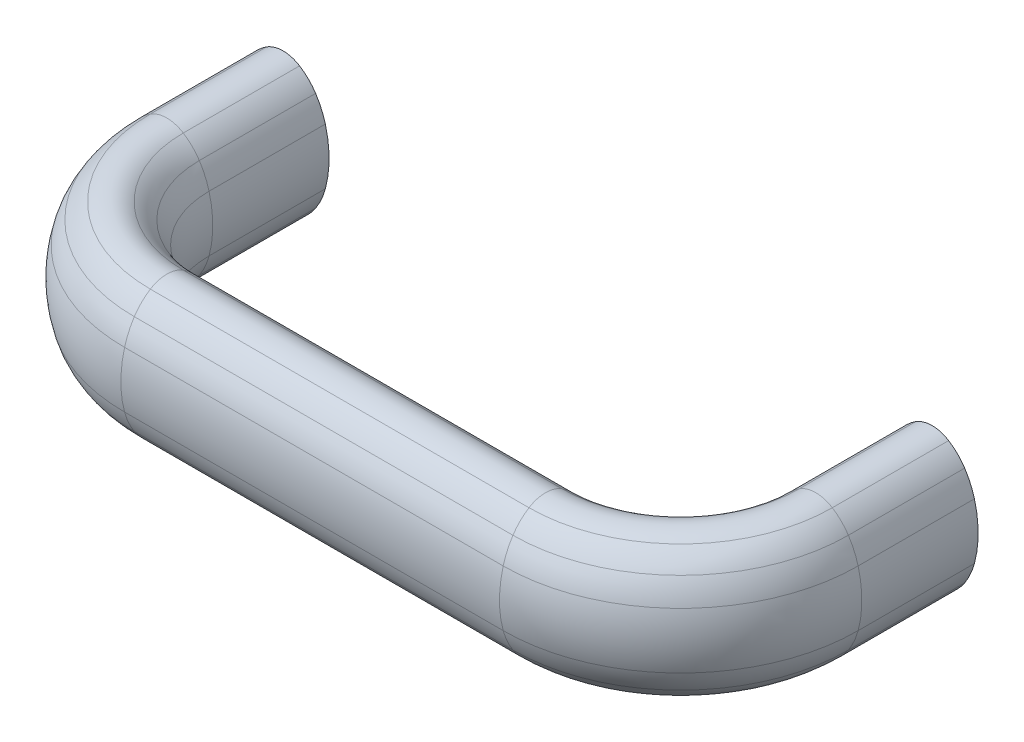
ISO-10303-21;
HEADER;
FILE_DESCRIPTION(('STEP AP214'),'2;1');
FILE_NAME('part.step','',(''),(''),'','','');
FILE_SCHEMA(('AUTOMOTIVE_DESIGN { 1 0 10303 214 1 1 1 1 }'));
ENDSEC;
DATA;
#1=APPLICATION_CONTEXT('core data for automotive mechanical design processes');
#2=APPLICATION_PROTOCOL_DEFINITION('international standard','automotive_design',2000,#1);
#3=PRODUCT_CONTEXT('',#1,'mechanical');
#4=PRODUCT('Part','Part','',(#3));
#5=PRODUCT_RELATED_PRODUCT_CATEGORY('part','',(#4));
#6=PRODUCT_DEFINITION_FORMATION('','',#4);
#7=PRODUCT_DEFINITION_CONTEXT('part definition',#1,'design');
#8=PRODUCT_DEFINITION('design','',#6,#7);
#9=PRODUCT_DEFINITION_SHAPE('','',#8);
#10=(LENGTH_UNIT() NAMED_UNIT(*) SI_UNIT(.MILLI.,.METRE.));
#11=(NAMED_UNIT(*) PLANE_ANGLE_UNIT() SI_UNIT($,.RADIAN.));
#12=(NAMED_UNIT(*) SI_UNIT($,.STERADIAN.) SOLID_ANGLE_UNIT());
#13=UNCERTAINTY_MEASURE_WITH_UNIT(LENGTH_MEASURE(1.E-05),#10,'distance_accuracy_value','');
#14=(GEOMETRIC_REPRESENTATION_CONTEXT(3) GLOBAL_UNCERTAINTY_ASSIGNED_CONTEXT((#13)) GLOBAL_UNIT_ASSIGNED_CONTEXT((#10,
#11,#12)) REPRESENTATION_CONTEXT('',''));
#15=CARTESIAN_POINT('',(0.,0.,0.));
#16=DIRECTION('',(0.,0.,1.));
#17=DIRECTION('',(1.,0.,0.));
#18=AXIS2_PLACEMENT_3D('',#15,#16,#17);
#19=CARTESIAN_POINT('',(121.10831860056,-5.5628443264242,0.));
#20=DIRECTION('',(0.,0.,-1.));
#21=DIRECTION('',(0.,-1.,0.));
#22=AXIS2_PLACEMENT_3D('',#19,#20,#21);
#23=PLANE('',#22);
#24=CARTESIAN_POINT('',(119.999387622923,-7.31331876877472,0.));
#25=DIRECTION('',(0.,0.,-1.));
#26=DIRECTION('',(0.,-1.,0.));
#27=AXIS2_PLACEMENT_3D('',#24,#25,#26);
#28=CIRCLE('',#27,5.68668538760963);
#29=CARTESIAN_POINT('',(123.042642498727,-12.1171703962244,0.));
#30=VERTEX_POINT('',#29);
#31=CARTESIAN_POINT('',(116.95613274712,-12.1171703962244,0.));
#32=VERTEX_POINT('',#31);
#33=EDGE_CURVE('E540',#30,#32,#28,.T.);
#34=ORIENTED_EDGE('',*,*,#33,.T.);
#35=CARTESIAN_POINT('',(122.217249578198,-3.81236988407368,0.));
#36=DIRECTION('',(0.,0.,-1.));
#37=DIRECTION('',(0.,-1.,0.));
#38=AXIS2_PLACEMENT_3D('',#35,#36,#37);
#39=CIRCLE('',#38,9.83102547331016);
#40=CARTESIAN_POINT('',(113.988979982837,-9.19239231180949,0.));
#41=VERTEX_POINT('',#40);
#42=EDGE_CURVE('E18',#32,#41,#39,.T.);
#43=ORIENTED_EDGE('',*,*,#42,.T.);
#44=CARTESIAN_POINT('',(125.739270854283,-1.50950981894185,0.));
#45=DIRECTION('',(0.,0.,-1.));
#46=DIRECTION('',(0.,-1.,0.));
#47=AXIS2_PLACEMENT_3D('',#44,#45,#46);
#48=CIRCLE('',#47,14.0390889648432);
#49=CARTESIAN_POINT('',(112.188367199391,-5.17952740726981,0.));
#50=VERTEX_POINT('',#49);
#51=EDGE_CURVE('E38',#41,#50,#48,.T.);
#52=ORIENTED_EDGE('',*,*,#51,.T.);
#53=CARTESIAN_POINT('',(131.312858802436,-4.15638432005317E-06,0.));
#54=DIRECTION('',(0.,0.,-1.));
#55=DIRECTION('',(0.,-1.,0.));
#56=AXIS2_PLACEMENT_3D('',#53,#54,#55);
#57=CIRCLE('',#56,19.8134711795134);
#58=CARTESIAN_POINT('',(112.188367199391,5.17951909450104,0.));
#59=VERTEX_POINT('',#58);
#60=EDGE_CURVE('E623',#50,#59,#57,.T.);
#61=ORIENTED_EDGE('',*,*,#60,.T.);
#62=CARTESIAN_POINT('',(125.739270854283,1.50950150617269,0.));
#63=DIRECTION('',(0.,0.,-1.));
#64=DIRECTION('',(0.,-1.,0.));
#65=AXIS2_PLACEMENT_3D('',#62,#63,#64);
#66=CIRCLE('',#65,14.0390889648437);
#67=CARTESIAN_POINT('',(113.988979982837,9.19238399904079,0.));
#68=VERTEX_POINT('',#67);
#69=EDGE_CURVE('E620',#59,#68,#66,.T.);
#70=ORIENTED_EDGE('',*,*,#69,.T.);
#71=CARTESIAN_POINT('',(122.217249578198,3.81236157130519,0.));
#72=DIRECTION('',(0.,0.,-1.));
#73=DIRECTION('',(0.,-1.,0.));
#74=AXIS2_PLACEMENT_3D('',#71,#72,#73);
#75=CIRCLE('',#74,9.83102547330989);
#76=CARTESIAN_POINT('',(116.95613274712,12.1171620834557,0.));
#77=VERTEX_POINT('',#76);
#78=EDGE_CURVE('E617',#68,#77,#75,.T.);
#79=ORIENTED_EDGE('',*,*,#78,.T.);
#80=CARTESIAN_POINT('',(119.999387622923,7.31331045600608,0.));
#81=DIRECTION('',(0.,0.,1.));
#82=DIRECTION('',(0.,1.,0.));
#83=AXIS2_PLACEMENT_3D('',#80,#81,#82);
#84=CIRCLE('',#83,5.68668538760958);
#85=CARTESIAN_POINT('',(123.042642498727,12.1171620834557,0.));
#86=VERTEX_POINT('',#85);
#87=EDGE_CURVE('E615',#86,#77,#84,.T.);
#88=ORIENTED_EDGE('',*,*,#87,.F.);
#89=CARTESIAN_POINT('',(117.781525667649,3.81236157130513,0.));
#90=DIRECTION('',(0.,0.,1.));
#91=DIRECTION('',(0.,1.,0.));
#92=AXIS2_PLACEMENT_3D('',#89,#90,#91);
#93=CIRCLE('',#92,9.83102547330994);
#94=CARTESIAN_POINT('',(126.009795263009,9.19238399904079,0.));
#95=VERTEX_POINT('',#94);
#96=EDGE_CURVE('E613',#95,#86,#93,.T.);
#97=ORIENTED_EDGE('',*,*,#96,.F.);
#98=CARTESIAN_POINT('',(114.259504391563,1.50950150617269,0.));
#99=DIRECTION('',(0.,0.,1.));
#100=DIRECTION('',(0.,1.,0.));
#101=AXIS2_PLACEMENT_3D('',#98,#99,#100);
#102=CIRCLE('',#101,14.0390889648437);
#103=CARTESIAN_POINT('',(127.810408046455,5.17951909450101,0.));
#104=VERTEX_POINT('',#103);
#105=EDGE_CURVE('E611',#104,#95,#102,.T.);
#106=ORIENTED_EDGE('',*,*,#105,.F.);
#107=CARTESIAN_POINT('',(108.68591644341,-4.1563845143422E-06,0.));
#108=DIRECTION('',(0.,0.,1.));
#109=DIRECTION('',(0.,1.,0.));
#110=AXIS2_PLACEMENT_3D('',#107,#108,#109);
#111=CIRCLE('',#110,19.8134711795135);
#112=CARTESIAN_POINT('',(127.810408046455,-5.17952740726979,0.));
#113=VERTEX_POINT('',#112);
#114=EDGE_CURVE('E609',#113,#104,#111,.T.);
#115=ORIENTED_EDGE('',*,*,#114,.F.);
#116=CARTESIAN_POINT('',(114.259504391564,-1.50950981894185,0.));
#117=DIRECTION('',(0.,0.,1.));
#118=DIRECTION('',(0.,1.,0.));
#119=AXIS2_PLACEMENT_3D('',#116,#117,#118);
#120=CIRCLE('',#119,14.0390889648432);
#121=CARTESIAN_POINT('',(126.009795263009,-9.19239231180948,0.));
#122=VERTEX_POINT('',#121);
#123=EDGE_CURVE('E607',#122,#113,#120,.T.);
#124=ORIENTED_EDGE('',*,*,#123,.F.);
#125=CARTESIAN_POINT('',(117.781525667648,-3.81236988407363,0.));
#126=DIRECTION('',(0.,0.,1.));
#127=DIRECTION('',(0.,1.,0.));
#128=AXIS2_PLACEMENT_3D('',#125,#126,#127);
#129=CIRCLE('',#128,9.83102547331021);
#130=EDGE_CURVE('E605',#30,#122,#129,.T.);
#131=ORIENTED_EDGE('',*,*,#130,.F.);
#132=EDGE_LOOP('',(#34,#43,#52,#61,#70,#79,#88,#97,#106,#115,#124,#131));
#133=FACE_BOUND('',#132,.T.);
#134=CARTESIAN_POINT('',(120.,0.,0.));
#135=DIRECTION('',(0.,0.,1.));
#136=DIRECTION('',(0.,1.,0.));
#137=AXIS2_PLACEMENT_3D('',#134,#135,#136);
#138=CIRCLE('',#137,4.52350000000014);
#139=CARTESIAN_POINT('',(120.,4.52350000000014,0.));
#140=VERTEX_POINT('',#139);
#141=EDGE_CURVE('E1387',#140,#140,#138,.T.);
#142=ORIENTED_EDGE('',*,*,#141,.T.);
#143=EDGE_LOOP('',(#142));
#144=FACE_BOUND('',#143,.T.);
#145=ADVANCED_FACE('F14',(#133,#144),#23,.T.);
#146=CARTESIAN_POINT('',(-1.10831860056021,-5.5628443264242,0.));
#147=DIRECTION('',(0.,0.,1.));
#148=DIRECTION('',(0.,-1.,0.));
#149=AXIS2_PLACEMENT_3D('',#146,#147,#148);
#150=PLANE('',#149);
#151=CARTESIAN_POINT('',(0.000612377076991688,-7.31331876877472,0.));
#152=DIRECTION('',(0.,0.,1.));
#153=DIRECTION('',(0.,-1.,0.));
#154=AXIS2_PLACEMENT_3D('',#151,#152,#153);
#155=CIRCLE('',#154,5.68668538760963);
#156=CARTESIAN_POINT('',(-3.04264249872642,-12.1171703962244,0.));
#157=VERTEX_POINT('',#156);
#158=CARTESIAN_POINT('',(3.04386725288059,-12.1171703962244,0.));
#159=VERTEX_POINT('',#158);
#160=EDGE_CURVE('E264',#157,#159,#155,.T.);
#161=ORIENTED_EDGE('',*,*,#160,.F.);
#162=CARTESIAN_POINT('',(2.21847433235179,-3.81236988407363,0.));
#163=DIRECTION('',(0.,0.,-1.));
#164=DIRECTION('',(0.,1.,0.));
#165=AXIS2_PLACEMENT_3D('',#162,#163,#164);
#166=CIRCLE('',#165,9.83102547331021);
#167=CARTESIAN_POINT('',(-6.00979526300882,-9.19239231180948,0.));
#168=VERTEX_POINT('',#167);
#169=EDGE_CURVE('E305',#157,#168,#166,.T.);
#170=ORIENTED_EDGE('',*,*,#169,.T.);
#171=CARTESIAN_POINT('',(5.74049560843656,-1.50950981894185,0.));
#172=DIRECTION('',(0.,0.,-1.));
#173=DIRECTION('',(0.,1.,0.));
#174=AXIS2_PLACEMENT_3D('',#171,#172,#173);
#175=CIRCLE('',#174,14.0390889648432);
#176=CARTESIAN_POINT('',(-7.81040804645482,-5.17952740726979,0.));
#177=VERTEX_POINT('',#176);
#178=EDGE_CURVE('E302',#168,#177,#175,.T.);
#179=ORIENTED_EDGE('',*,*,#178,.T.);
#180=CARTESIAN_POINT('',(11.3140835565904,-4.1563845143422E-06,0.));
#181=DIRECTION('',(0.,0.,-1.));
#182=DIRECTION('',(0.,1.,0.));
#183=AXIS2_PLACEMENT_3D('',#180,#181,#182);
#184=CIRCLE('',#183,19.8134711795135);
#185=CARTESIAN_POINT('',(-7.81040804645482,5.17951909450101,0.));
#186=VERTEX_POINT('',#185);
#187=EDGE_CURVE('E299',#177,#186,#184,.T.);
#188=ORIENTED_EDGE('',*,*,#187,.T.);
#189=CARTESIAN_POINT('',(5.74049560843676,1.50950150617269,0.));
#190=DIRECTION('',(0.,0.,-1.));
#191=DIRECTION('',(0.,1.,0.));
#192=AXIS2_PLACEMENT_3D('',#189,#190,#191);
#193=CIRCLE('',#192,14.0390889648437);
#194=CARTESIAN_POINT('',(-6.00979526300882,9.19238399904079,0.));
#195=VERTEX_POINT('',#194);
#196=EDGE_CURVE('E296',#186,#195,#193,.T.);
#197=ORIENTED_EDGE('',*,*,#196,.T.);
#198=CARTESIAN_POINT('',(2.21847433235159,3.81236157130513,0.));
#199=DIRECTION('',(0.,0.,-1.));
#200=DIRECTION('',(0.,1.,0.));
#201=AXIS2_PLACEMENT_3D('',#198,#199,#200);
#202=CIRCLE('',#201,9.83102547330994);
#203=CARTESIAN_POINT('',(-3.04264249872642,12.1171620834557,0.));
#204=VERTEX_POINT('',#203);
#205=EDGE_CURVE('E293',#195,#204,#202,.T.);
#206=ORIENTED_EDGE('',*,*,#205,.T.);
#207=CARTESIAN_POINT('',(0.000612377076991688,7.31331045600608,0.));
#208=DIRECTION('',(0.,0.,1.));
#209=DIRECTION('',(0.,-1.,0.));
#210=AXIS2_PLACEMENT_3D('',#207,#208,#209);
#211=CIRCLE('',#210,5.68668538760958);
#212=CARTESIAN_POINT('',(3.04386725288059,12.1171620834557,0.));
#213=VERTEX_POINT('',#212);
#214=EDGE_CURVE('E291',#213,#204,#211,.T.);
#215=ORIENTED_EDGE('',*,*,#214,.F.);
#216=CARTESIAN_POINT('',(-2.21724957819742,3.81236157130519,0.));
#217=DIRECTION('',(0.,0.,1.));
#218=DIRECTION('',(0.,-1.,0.));
#219=AXIS2_PLACEMENT_3D('',#216,#217,#218);
#220=CIRCLE('',#219,9.83102547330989);
#221=CARTESIAN_POINT('',(6.01102001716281,9.19238399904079,0.));
#222=VERTEX_POINT('',#221);
#223=EDGE_CURVE('E288',#222,#213,#220,.T.);
#224=ORIENTED_EDGE('',*,*,#223,.F.);
#225=CARTESIAN_POINT('',(-5.73927085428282,1.50950150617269,0.));
#226=DIRECTION('',(0.,0.,1.));
#227=DIRECTION('',(0.,-1.,0.));
#228=AXIS2_PLACEMENT_3D('',#225,#226,#227);
#229=CIRCLE('',#228,14.0390889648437);
#230=CARTESIAN_POINT('',(7.81163280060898,5.17951909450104,0.));
#231=VERTEX_POINT('',#230);
#232=EDGE_CURVE('E285',#231,#222,#229,.T.);
#233=ORIENTED_EDGE('',*,*,#232,.F.);
#234=CARTESIAN_POINT('',(-11.3128588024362,-4.15638432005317E-06,0.));
#235=DIRECTION('',(0.,0.,1.));
#236=DIRECTION('',(0.,-1.,0.));
#237=AXIS2_PLACEMENT_3D('',#234,#235,#236);
#238=CIRCLE('',#237,19.8134711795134);
#239=CARTESIAN_POINT('',(7.81163280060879,-5.17952740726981,0.));
#240=VERTEX_POINT('',#239);
#241=EDGE_CURVE('E279',#240,#231,#238,.T.);
#242=ORIENTED_EDGE('',*,*,#241,.F.);
#243=CARTESIAN_POINT('',(-5.73927085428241,-1.50950981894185,0.));
#244=DIRECTION('',(0.,0.,1.));
#245=DIRECTION('',(0.,-1.,0.));
#246=AXIS2_PLACEMENT_3D('',#243,#244,#245);
#247=CIRCLE('',#246,14.0390889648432);
#248=CARTESIAN_POINT('',(6.01102001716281,-9.19239231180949,0.));
#249=VERTEX_POINT('',#248);
#250=EDGE_CURVE('E277',#249,#240,#247,.T.);
#251=ORIENTED_EDGE('',*,*,#250,.F.);
#252=CARTESIAN_POINT('',(-2.21724957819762,-3.81236988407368,0.));
#253=DIRECTION('',(0.,0.,1.));
#254=DIRECTION('',(0.,-1.,0.));
#255=AXIS2_PLACEMENT_3D('',#252,#253,#254);
#256=CIRCLE('',#255,9.83102547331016);
#257=EDGE_CURVE('E255',#159,#249,#256,.T.);
#258=ORIENTED_EDGE('',*,*,#257,.F.);
#259=EDGE_LOOP('',(#161,#170,#179,#188,#197,#206,#215,#224,#233,#242,#251,#258));
#260=FACE_BOUND('',#259,.T.);
#261=CARTESIAN_POINT('',(0.,0.,0.));
#262=DIRECTION('',(0.,0.,-1.));
#263=DIRECTION('',(0.,1.,0.));
#264=AXIS2_PLACEMENT_3D('',#261,#262,#263);
#265=CIRCLE('',#264,4.52350000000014);
#266=CARTESIAN_POINT('',(0.,4.52350000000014,0.));
#267=VERTEX_POINT('',#266);
#268=EDGE_CURVE('E271',#267,#267,#265,.T.);
#269=ORIENTED_EDGE('',*,*,#268,.F.);
#270=EDGE_LOOP('',(#269));
#271=FACE_BOUND('',#270,.T.);
#272=ADVANCED_FACE('F273',(#260,#271),#150,.F.);
#273=CARTESIAN_POINT('',(122.217249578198,-3.81236988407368,21.5));
#274=DIRECTION('',(0.,0.,-1.));
#275=DIRECTION('',(0.,1.,0.));
#276=AXIS2_PLACEMENT_3D('',#273,#274,#275);
#277=CYLINDRICAL_SURFACE('',#276,9.83102547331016);
#278=CARTESIAN_POINT('',(122.217249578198,-3.81236988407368,21.5));
#279=DIRECTION('',(0.,0.,-1.));
#280=DIRECTION('',(0.,-1.,0.));
#281=AXIS2_PLACEMENT_3D('',#278,#279,#280);
#282=CIRCLE('',#281,9.83102547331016);
#283=CARTESIAN_POINT('',(116.95613274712,-12.1171703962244,21.5));
#284=VERTEX_POINT('',#283);
#285=CARTESIAN_POINT('',(113.988979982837,-9.19239231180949,21.5));
#286=VERTEX_POINT('',#285);
#287=EDGE_CURVE('E507',#284,#286,#282,.T.);
#288=ORIENTED_EDGE('',*,*,#287,.T.);
#289=DIRECTION('',(0.,0.,-1.));
#290=VECTOR('',#289,1.);
#291=CARTESIAN_POINT('',(113.988979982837,-9.19239231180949,21.5));
#292=LINE('',#291,#290);
#293=EDGE_CURVE('E23',#286,#41,#292,.T.);
#294=ORIENTED_EDGE('',*,*,#293,.T.);
#295=ORIENTED_EDGE('',*,*,#42,.F.);
#296=DIRECTION('',(0.,0.,-1.));
#297=VECTOR('',#296,1.);
#298=CARTESIAN_POINT('',(116.95613274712,-12.1171703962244,21.5));
#299=LINE('',#298,#297);
#300=EDGE_CURVE('E9',#284,#32,#299,.T.);
#301=ORIENTED_EDGE('',*,*,#300,.F.);
#302=EDGE_LOOP('',(#288,#294,#295,#301));
#303=FACE_BOUND('',#302,.T.);
#304=ADVANCED_FACE('F16',(#303),#277,.T.);
#305=CARTESIAN_POINT('',(125.739270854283,-1.50950981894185,21.5));
#306=DIRECTION('',(0.,0.,-1.));
#307=DIRECTION('',(0.,1.,0.));
#308=AXIS2_PLACEMENT_3D('',#305,#306,#307);
#309=CYLINDRICAL_SURFACE('',#308,14.0390889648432);
#310=CARTESIAN_POINT('',(125.739270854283,-1.50950981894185,21.5));
#311=DIRECTION('',(0.,0.,-1.));
#312=DIRECTION('',(0.,-1.,0.));
#313=AXIS2_PLACEMENT_3D('',#310,#311,#312);
#314=CIRCLE('',#313,14.0390889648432);
#315=CARTESIAN_POINT('',(112.188367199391,-5.17952740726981,21.5));
#316=VERTEX_POINT('',#315);
#317=EDGE_CURVE('E569',#286,#316,#314,.T.);
#318=ORIENTED_EDGE('',*,*,#317,.T.);
#319=DIRECTION('',(0.,0.,-1.));
#320=VECTOR('',#319,1.);
#321=CARTESIAN_POINT('',(112.188367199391,-5.17952740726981,21.5));
#322=LINE('',#321,#320);
#323=EDGE_CURVE('E601',#316,#50,#322,.T.);
#324=ORIENTED_EDGE('',*,*,#323,.T.);
#325=ORIENTED_EDGE('',*,*,#51,.F.);
#326=ORIENTED_EDGE('',*,*,#293,.F.);
#327=EDGE_LOOP('',(#318,#324,#325,#326));
#328=FACE_BOUND('',#327,.T.);
#329=ADVANCED_FACE('F630',(#328),#309,.T.);
#330=CARTESIAN_POINT('',(131.312858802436,-4.15638432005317E-06,21.5));
#331=DIRECTION('',(0.,0.,-1.));
#332=DIRECTION('',(0.,1.,0.));
#333=AXIS2_PLACEMENT_3D('',#330,#331,#332);
#334=CYLINDRICAL_SURFACE('',#333,19.8134711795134);
#335=CARTESIAN_POINT('',(131.312858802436,-4.15638432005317E-06,21.5));
#336=DIRECTION('',(0.,0.,-1.));
#337=DIRECTION('',(0.,-1.,0.));
#338=AXIS2_PLACEMENT_3D('',#335,#336,#337);
#339=CIRCLE('',#338,19.8134711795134);
#340=CARTESIAN_POINT('',(112.188367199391,5.17951909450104,21.5));
#341=VERTEX_POINT('',#340);
#342=EDGE_CURVE('E566',#316,#341,#339,.T.);
#343=ORIENTED_EDGE('',*,*,#342,.T.);
#344=DIRECTION('',(0.,0.,-1.));
#345=VECTOR('',#344,1.);
#346=CARTESIAN_POINT('',(112.188367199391,5.17951909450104,21.5));
#347=LINE('',#346,#345);
#348=EDGE_CURVE('E598',#341,#59,#347,.T.);
#349=ORIENTED_EDGE('',*,*,#348,.T.);
#350=ORIENTED_EDGE('',*,*,#60,.F.);
#351=ORIENTED_EDGE('',*,*,#323,.F.);
#352=EDGE_LOOP('',(#343,#349,#350,#351));
#353=FACE_BOUND('',#352,.T.);
#354=ADVANCED_FACE('F685',(#353),#334,.T.);
#355=CARTESIAN_POINT('',(125.739270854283,1.50950150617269,21.5));
#356=DIRECTION('',(0.,0.,-1.));
#357=DIRECTION('',(0.,1.,0.));
#358=AXIS2_PLACEMENT_3D('',#355,#356,#357);
#359=CYLINDRICAL_SURFACE('',#358,14.0390889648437);
#360=CARTESIAN_POINT('',(125.739270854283,1.50950150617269,21.5));
#361=DIRECTION('',(0.,0.,-1.));
#362=DIRECTION('',(0.,-1.,0.));
#363=AXIS2_PLACEMENT_3D('',#360,#361,#362);
#364=CIRCLE('',#363,14.0390889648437);
#365=CARTESIAN_POINT('',(113.988979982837,9.19238399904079,21.5));
#366=VERTEX_POINT('',#365);
#367=EDGE_CURVE('E563',#341,#366,#364,.T.);
#368=ORIENTED_EDGE('',*,*,#367,.T.);
#369=DIRECTION('',(0.,0.,-1.));
#370=VECTOR('',#369,1.);
#371=CARTESIAN_POINT('',(113.988979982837,9.19238399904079,21.5));
#372=LINE('',#371,#370);
#373=EDGE_CURVE('E595',#366,#68,#372,.T.);
#374=ORIENTED_EDGE('',*,*,#373,.T.);
#375=ORIENTED_EDGE('',*,*,#69,.F.);
#376=ORIENTED_EDGE('',*,*,#348,.F.);
#377=EDGE_LOOP('',(#368,#374,#375,#376));
#378=FACE_BOUND('',#377,.T.);
#379=ADVANCED_FACE('F684',(#378),#359,.T.);
#380=CARTESIAN_POINT('',(122.217249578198,3.81236157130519,21.5));
#381=DIRECTION('',(0.,0.,-1.));
#382=DIRECTION('',(0.,1.,0.));
#383=AXIS2_PLACEMENT_3D('',#380,#381,#382);
#384=CYLINDRICAL_SURFACE('',#383,9.83102547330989);
#385=CARTESIAN_POINT('',(122.217249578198,3.81236157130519,21.5));
#386=DIRECTION('',(0.,0.,-1.));
#387=DIRECTION('',(0.,-1.,0.));
#388=AXIS2_PLACEMENT_3D('',#385,#386,#387);
#389=CIRCLE('',#388,9.83102547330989);
#390=CARTESIAN_POINT('',(116.95613274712,12.1171620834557,21.5));
#391=VERTEX_POINT('',#390);
#392=EDGE_CURVE('E560',#366,#391,#389,.T.);
#393=ORIENTED_EDGE('',*,*,#392,.T.);
#394=DIRECTION('',(0.,0.,-1.));
#395=VECTOR('',#394,1.);
#396=CARTESIAN_POINT('',(116.95613274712,12.1171620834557,21.5));
#397=LINE('',#396,#395);
#398=EDGE_CURVE('E592',#391,#77,#397,.T.);
#399=ORIENTED_EDGE('',*,*,#398,.T.);
#400=ORIENTED_EDGE('',*,*,#78,.F.);
#401=ORIENTED_EDGE('',*,*,#373,.F.);
#402=EDGE_LOOP('',(#393,#399,#400,#401));
#403=FACE_BOUND('',#402,.T.);
#404=ADVANCED_FACE('F690',(#403),#384,.T.);
#405=CARTESIAN_POINT('',(119.999387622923,7.31331045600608,21.5));
#406=DIRECTION('',(0.,0.,-1.));
#407=DIRECTION('',(0.,1.,0.));
#408=AXIS2_PLACEMENT_3D('',#405,#406,#407);
#409=CYLINDRICAL_SURFACE('',#408,5.68668538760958);
#410=CARTESIAN_POINT('',(119.999387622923,7.31331045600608,21.5));
#411=DIRECTION('',(0.,0.,1.));
#412=DIRECTION('',(0.,1.,0.));
#413=AXIS2_PLACEMENT_3D('',#410,#411,#412);
#414=CIRCLE('',#413,5.68668538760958);
#415=CARTESIAN_POINT('',(123.042642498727,12.1171620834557,21.5));
#416=VERTEX_POINT('',#415);
#417=EDGE_CURVE('E558',#416,#391,#414,.T.);
#418=ORIENTED_EDGE('',*,*,#417,.F.);
#419=DIRECTION('',(0.,0.,-1.));
#420=VECTOR('',#419,1.);
#421=CARTESIAN_POINT('',(123.042642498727,12.1171620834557,21.5));
#422=LINE('',#421,#420);
#423=EDGE_CURVE('E589',#416,#86,#422,.T.);
#424=ORIENTED_EDGE('',*,*,#423,.T.);
#425=ORIENTED_EDGE('',*,*,#87,.T.);
#426=ORIENTED_EDGE('',*,*,#398,.F.);
#427=EDGE_LOOP('',(#418,#424,#425,#426));
#428=FACE_BOUND('',#427,.T.);
#429=ADVANCED_FACE('F693',(#428),#409,.T.);
#430=CARTESIAN_POINT('',(117.781525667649,3.81236157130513,21.5));
#431=DIRECTION('',(0.,0.,-1.));
#432=DIRECTION('',(0.,1.,0.));
#433=AXIS2_PLACEMENT_3D('',#430,#431,#432);
#434=CYLINDRICAL_SURFACE('',#433,9.83102547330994);
#435=CARTESIAN_POINT('',(117.781525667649,3.81236157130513,21.5));
#436=DIRECTION('',(0.,0.,1.));
#437=DIRECTION('',(0.,1.,0.));
#438=AXIS2_PLACEMENT_3D('',#435,#436,#437);
#439=CIRCLE('',#438,9.83102547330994);
#440=CARTESIAN_POINT('',(126.009795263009,9.19238399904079,21.5));
#441=VERTEX_POINT('',#440);
#442=EDGE_CURVE('E555',#441,#416,#439,.T.);
#443=ORIENTED_EDGE('',*,*,#442,.F.);
#444=DIRECTION('',(0.,0.,-1.));
#445=VECTOR('',#444,1.);
#446=CARTESIAN_POINT('',(126.009795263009,9.19238399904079,21.5));
#447=LINE('',#446,#445);
#448=EDGE_CURVE('E586',#441,#95,#447,.T.);
#449=ORIENTED_EDGE('',*,*,#448,.T.);
#450=ORIENTED_EDGE('',*,*,#96,.T.);
#451=ORIENTED_EDGE('',*,*,#423,.F.);
#452=EDGE_LOOP('',(#443,#449,#450,#451));
#453=FACE_BOUND('',#452,.T.);
#454=ADVANCED_FACE('F696',(#453),#434,.T.);
#455=CARTESIAN_POINT('',(114.259504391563,1.50950150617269,21.5));
#456=DIRECTION('',(0.,0.,-1.));
#457=DIRECTION('',(0.,1.,0.));
#458=AXIS2_PLACEMENT_3D('',#455,#456,#457);
#459=CYLINDRICAL_SURFACE('',#458,14.0390889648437);
#460=CARTESIAN_POINT('',(114.259504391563,1.50950150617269,21.5));
#461=DIRECTION('',(0.,0.,1.));
#462=DIRECTION('',(0.,1.,0.));
#463=AXIS2_PLACEMENT_3D('',#460,#461,#462);
#464=CIRCLE('',#463,14.0390889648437);
#465=CARTESIAN_POINT('',(127.810408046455,5.17951909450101,21.5));
#466=VERTEX_POINT('',#465);
#467=EDGE_CURVE('E552',#466,#441,#464,.T.);
#468=ORIENTED_EDGE('',*,*,#467,.F.);
#469=DIRECTION('',(0.,0.,-1.));
#470=VECTOR('',#469,1.);
#471=CARTESIAN_POINT('',(127.810408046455,5.17951909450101,21.5));
#472=LINE('',#471,#470);
#473=EDGE_CURVE('E583',#466,#104,#472,.T.);
#474=ORIENTED_EDGE('',*,*,#473,.T.);
#475=ORIENTED_EDGE('',*,*,#105,.T.);
#476=ORIENTED_EDGE('',*,*,#448,.F.);
#477=EDGE_LOOP('',(#468,#474,#475,#476));
#478=FACE_BOUND('',#477,.T.);
#479=ADVANCED_FACE('F702',(#478),#459,.T.);
#480=CARTESIAN_POINT('',(108.68591644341,-4.1563845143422E-06,21.5));
#481=DIRECTION('',(0.,0.,-1.));
#482=DIRECTION('',(0.,1.,0.));
#483=AXIS2_PLACEMENT_3D('',#480,#481,#482);
#484=CYLINDRICAL_SURFACE('',#483,19.8134711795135);
#485=CARTESIAN_POINT('',(108.68591644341,-4.1563845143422E-06,21.5));
#486=DIRECTION('',(0.,0.,1.));
#487=DIRECTION('',(0.,1.,0.));
#488=AXIS2_PLACEMENT_3D('',#485,#486,#487);
#489=CIRCLE('',#488,19.8134711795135);
#490=CARTESIAN_POINT('',(127.810408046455,-5.17952740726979,21.5));
#491=VERTEX_POINT('',#490);
#492=EDGE_CURVE('E549',#491,#466,#489,.T.);
#493=ORIENTED_EDGE('',*,*,#492,.F.);
#494=DIRECTION('',(0.,0.,-1.));
#495=VECTOR('',#494,1.);
#496=CARTESIAN_POINT('',(127.810408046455,-5.17952740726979,21.5));
#497=LINE('',#496,#495);
#498=EDGE_CURVE('E580',#491,#113,#497,.T.);
#499=ORIENTED_EDGE('',*,*,#498,.T.);
#500=ORIENTED_EDGE('',*,*,#114,.T.);
#501=ORIENTED_EDGE('',*,*,#473,.F.);
#502=EDGE_LOOP('',(#493,#499,#500,#501));
#503=FACE_BOUND('',#502,.T.);
#504=ADVANCED_FACE('F705',(#503),#484,.T.);
#505=CARTESIAN_POINT('',(114.259504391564,-1.50950981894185,21.5));
#506=DIRECTION('',(0.,0.,-1.));
#507=DIRECTION('',(0.,1.,0.));
#508=AXIS2_PLACEMENT_3D('',#505,#506,#507);
#509=CYLINDRICAL_SURFACE('',#508,14.0390889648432);
#510=CARTESIAN_POINT('',(114.259504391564,-1.50950981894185,21.5));
#511=DIRECTION('',(0.,0.,1.));
#512=DIRECTION('',(0.,1.,0.));
#513=AXIS2_PLACEMENT_3D('',#510,#511,#512);
#514=CIRCLE('',#513,14.0390889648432);
#515=CARTESIAN_POINT('',(126.009795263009,-9.19239231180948,21.5));
#516=VERTEX_POINT('',#515);
#517=EDGE_CURVE('E546',#516,#491,#514,.T.);
#518=ORIENTED_EDGE('',*,*,#517,.F.);
#519=DIRECTION('',(0.,0.,-1.));
#520=VECTOR('',#519,1.);
#521=CARTESIAN_POINT('',(126.009795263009,-9.19239231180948,21.5));
#522=LINE('',#521,#520);
#523=EDGE_CURVE('E577',#516,#122,#522,.T.);
#524=ORIENTED_EDGE('',*,*,#523,.T.);
#525=ORIENTED_EDGE('',*,*,#123,.T.);
#526=ORIENTED_EDGE('',*,*,#498,.F.);
#527=EDGE_LOOP('',(#518,#524,#525,#526));
#528=FACE_BOUND('',#527,.T.);
#529=ADVANCED_FACE('F708',(#528),#509,.T.);
#530=CARTESIAN_POINT('',(117.781525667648,-3.81236988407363,21.5));
#531=DIRECTION('',(0.,0.,-1.));
#532=DIRECTION('',(0.,1.,0.));
#533=AXIS2_PLACEMENT_3D('',#530,#531,#532);
#534=CYLINDRICAL_SURFACE('',#533,9.83102547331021);
#535=CARTESIAN_POINT('',(117.781525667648,-3.81236988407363,21.5));
#536=DIRECTION('',(0.,0.,1.));
#537=DIRECTION('',(0.,1.,0.));
#538=AXIS2_PLACEMENT_3D('',#535,#536,#537);
#539=CIRCLE('',#538,9.83102547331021);
#540=CARTESIAN_POINT('',(123.042642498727,-12.1171703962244,21.5));
#541=VERTEX_POINT('',#540);
#542=EDGE_CURVE('E543',#541,#516,#539,.T.);
#543=ORIENTED_EDGE('',*,*,#542,.F.);
#544=DIRECTION('',(0.,0.,-1.));
#545=VECTOR('',#544,1.);
#546=CARTESIAN_POINT('',(123.042642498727,-12.1171703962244,21.5));
#547=LINE('',#546,#545);
#548=EDGE_CURVE('E574',#541,#30,#547,.T.);
#549=ORIENTED_EDGE('',*,*,#548,.T.);
#550=ORIENTED_EDGE('',*,*,#130,.T.);
#551=ORIENTED_EDGE('',*,*,#523,.F.);
#552=EDGE_LOOP('',(#543,#549,#550,#551));
#553=FACE_BOUND('',#552,.T.);
#554=ADVANCED_FACE('F712',(#553),#534,.T.);
#555=CARTESIAN_POINT('',(119.999387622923,-7.31331876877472,21.5));
#556=DIRECTION('',(0.,0.,-1.));
#557=DIRECTION('',(0.,1.,0.));
#558=AXIS2_PLACEMENT_3D('',#555,#556,#557);
#559=CYLINDRICAL_SURFACE('',#558,5.68668538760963);
#560=CARTESIAN_POINT('',(119.999387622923,-7.31331876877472,21.5));
#561=DIRECTION('',(0.,0.,-1.));
#562=DIRECTION('',(0.,-1.,0.));
#563=AXIS2_PLACEMENT_3D('',#560,#561,#562);
#564=CIRCLE('',#563,5.68668538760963);
#565=EDGE_CURVE('E469',#541,#284,#564,.T.);
#566=ORIENTED_EDGE('',*,*,#565,.T.);
#567=ORIENTED_EDGE('',*,*,#300,.T.);
#568=ORIENTED_EDGE('',*,*,#33,.F.);
#569=ORIENTED_EDGE('',*,*,#548,.F.);
#570=EDGE_LOOP('',(#566,#567,#568,#569));
#571=FACE_BOUND('',#570,.T.);
#572=ADVANCED_FACE('F714',(#571),#559,.T.);
#573=CARTESIAN_POINT('',(95.,-3.81236988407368,21.5));
#574=DIRECTION('',(0.,1.,0.));
#575=DIRECTION('',(-1.,0.,0.));
#576=AXIS2_PLACEMENT_3D('',#573,#574,#575);
#577=TOROIDAL_SURFACE('',#576,27.2172495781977,9.83102547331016);
#578=CARTESIAN_POINT('',(95.,-3.81236988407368,48.7172495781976));
#579=DIRECTION('',(1.,0.,0.));
#580=DIRECTION('',(0.,-1.,0.));
#581=AXIS2_PLACEMENT_3D('',#578,#579,#580);
#582=CIRCLE('',#581,9.83102547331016);
#583=CARTESIAN_POINT('',(95.,-12.1171703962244,43.4561327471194));
#584=VERTEX_POINT('',#583);
#585=CARTESIAN_POINT('',(95.,-9.19239231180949,40.4889799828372));
#586=VERTEX_POINT('',#585);
#587=EDGE_CURVE('E436',#584,#586,#582,.T.);
#588=ORIENTED_EDGE('',*,*,#587,.T.);
#589=CARTESIAN_POINT('',(95.,-9.19239231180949,21.5));
#590=DIRECTION('',(0.,1.,0.));
#591=DIRECTION('',(-1.,0.,0.));
#592=AXIS2_PLACEMENT_3D('',#589,#590,#591);
#593=CIRCLE('',#592,18.9889799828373);
#594=EDGE_CURVE('E534',#586,#286,#593,.T.);
#595=ORIENTED_EDGE('',*,*,#594,.T.);
#596=ORIENTED_EDGE('',*,*,#287,.F.);
#597=CARTESIAN_POINT('',(95.,-12.1171703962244,21.5));
#598=DIRECTION('',(0.,1.,0.));
#599=DIRECTION('',(-1.,0.,0.));
#600=AXIS2_PLACEMENT_3D('',#597,#598,#599);
#601=CIRCLE('',#600,21.9561327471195);
#602=EDGE_CURVE('E537',#584,#284,#601,.T.);
#603=ORIENTED_EDGE('',*,*,#602,.F.);
#604=EDGE_LOOP('',(#588,#595,#596,#603));
#605=FACE_BOUND('',#604,.T.);
#606=ADVANCED_FACE('F718',(#605),#577,.T.);
#607=CARTESIAN_POINT('',(95.,-1.50950981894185,21.5));
#608=DIRECTION('',(0.,1.,0.));
#609=DIRECTION('',(-1.,0.,0.));
#610=AXIS2_PLACEMENT_3D('',#607,#608,#609);
#611=TOROIDAL_SURFACE('',#610,30.7392708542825,14.0390889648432);
#612=CARTESIAN_POINT('',(95.,-1.50950981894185,52.2392708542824));
#613=DIRECTION('',(1.,0.,0.));
#614=DIRECTION('',(0.,-1.,0.));
#615=AXIS2_PLACEMENT_3D('',#612,#613,#614);
#616=CIRCLE('',#615,14.0390889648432);
#617=CARTESIAN_POINT('',(95.,-5.17952740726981,38.6883671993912));
#618=VERTEX_POINT('',#617);
#619=EDGE_CURVE('E498',#586,#618,#616,.T.);
#620=ORIENTED_EDGE('',*,*,#619,.T.);
#621=CARTESIAN_POINT('',(95.,-5.17952740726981,21.5));
#622=DIRECTION('',(0.,1.,0.));
#623=DIRECTION('',(-1.,0.,0.));
#624=AXIS2_PLACEMENT_3D('',#621,#622,#623);
#625=CIRCLE('',#624,17.1883671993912);
#626=EDGE_CURVE('E531',#618,#316,#625,.T.);
#627=ORIENTED_EDGE('',*,*,#626,.T.);
#628=ORIENTED_EDGE('',*,*,#317,.F.);
#629=ORIENTED_EDGE('',*,*,#594,.F.);
#630=EDGE_LOOP('',(#620,#627,#628,#629));
#631=FACE_BOUND('',#630,.T.);
#632=ADVANCED_FACE('F637',(#631),#611,.T.);
#633=CARTESIAN_POINT('',(95.,-4.15638432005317E-06,21.5));
#634=DIRECTION('',(0.,1.,0.));
#635=DIRECTION('',(-1.,0.,0.));
#636=AXIS2_PLACEMENT_3D('',#633,#634,#635);
#637=TOROIDAL_SURFACE('',#636,36.3128588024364,19.8134711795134);
#638=CARTESIAN_POINT('',(95.,-4.15638432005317E-06,57.8128588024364));
#639=DIRECTION('',(1.,0.,0.));
#640=DIRECTION('',(0.,-1.,0.));
#641=AXIS2_PLACEMENT_3D('',#638,#639,#640);
#642=CIRCLE('',#641,19.8134711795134);
#643=CARTESIAN_POINT('',(95.,5.17951909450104,38.6883671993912));
#644=VERTEX_POINT('',#643);
#645=EDGE_CURVE('E495',#618,#644,#642,.T.);
#646=ORIENTED_EDGE('',*,*,#645,.T.);
#647=CARTESIAN_POINT('',(95.,5.17951909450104,21.5));
#648=DIRECTION('',(0.,1.,0.));
#649=DIRECTION('',(-1.,0.,0.));
#650=AXIS2_PLACEMENT_3D('',#647,#648,#649);
#651=CIRCLE('',#650,17.1883671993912);
#652=EDGE_CURVE('E528',#644,#341,#651,.T.);
#653=ORIENTED_EDGE('',*,*,#652,.T.);
#654=ORIENTED_EDGE('',*,*,#342,.F.);
#655=ORIENTED_EDGE('',*,*,#626,.F.);
#656=EDGE_LOOP('',(#646,#653,#654,#655));
#657=FACE_BOUND('',#656,.T.);
#658=ADVANCED_FACE('F634',(#657),#637,.T.);
#659=CARTESIAN_POINT('',(95.,1.50950150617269,21.5));
#660=DIRECTION('',(0.,1.,0.));
#661=DIRECTION('',(-1.,0.,0.));
#662=AXIS2_PLACEMENT_3D('',#659,#660,#661);
#663=TOROIDAL_SURFACE('',#662,30.7392708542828,14.0390889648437);
#664=CARTESIAN_POINT('',(95.,1.50950150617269,52.2392708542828));
#665=DIRECTION('',(1.,0.,0.));
#666=DIRECTION('',(0.,-1.,0.));
#667=AXIS2_PLACEMENT_3D('',#664,#665,#666);
#668=CIRCLE('',#667,14.0390889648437);
#669=CARTESIAN_POINT('',(95.,9.19238399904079,40.4889799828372));
#670=VERTEX_POINT('',#669);
#671=EDGE_CURVE('E492',#644,#670,#668,.T.);
#672=ORIENTED_EDGE('',*,*,#671,.T.);
#673=CARTESIAN_POINT('',(95.,9.19238399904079,21.5));
#674=DIRECTION('',(0.,1.,0.));
#675=DIRECTION('',(-1.,0.,0.));
#676=AXIS2_PLACEMENT_3D('',#673,#674,#675);
#677=CIRCLE('',#676,18.9889799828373);
#678=EDGE_CURVE('E525',#670,#366,#677,.T.);
#679=ORIENTED_EDGE('',*,*,#678,.T.);
#680=ORIENTED_EDGE('',*,*,#367,.F.);
#681=ORIENTED_EDGE('',*,*,#652,.F.);
#682=EDGE_LOOP('',(#672,#679,#680,#681));
#683=FACE_BOUND('',#682,.T.);
#684=ADVANCED_FACE('F682',(#683),#663,.T.);
#685=CARTESIAN_POINT('',(95.,3.81236157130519,21.5));
#686=DIRECTION('',(0.,1.,0.));
#687=DIRECTION('',(-1.,0.,0.));
#688=AXIS2_PLACEMENT_3D('',#685,#686,#687);
#689=TOROIDAL_SURFACE('',#688,27.2172495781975,9.83102547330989);
#690=CARTESIAN_POINT('',(95.,3.81236157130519,48.7172495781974));
#691=DIRECTION('',(1.,0.,0.));
#692=DIRECTION('',(0.,-1.,0.));
#693=AXIS2_PLACEMENT_3D('',#690,#691,#692);
#694=CIRCLE('',#693,9.83102547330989);
#695=CARTESIAN_POINT('',(95.,12.1171620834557,43.4561327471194));
#696=VERTEX_POINT('',#695);
#697=EDGE_CURVE('E489',#670,#696,#694,.T.);
#698=ORIENTED_EDGE('',*,*,#697,.T.);
#699=CARTESIAN_POINT('',(95.,12.1171620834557,21.5));
#700=DIRECTION('',(0.,1.,0.));
#701=DIRECTION('',(-1.,0.,0.));
#702=AXIS2_PLACEMENT_3D('',#699,#700,#701);
#703=CIRCLE('',#702,21.9561327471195);
#704=EDGE_CURVE('E522',#696,#391,#703,.T.);
#705=ORIENTED_EDGE('',*,*,#704,.T.);
#706=ORIENTED_EDGE('',*,*,#392,.F.);
#707=ORIENTED_EDGE('',*,*,#678,.F.);
#708=EDGE_LOOP('',(#698,#705,#706,#707));
#709=FACE_BOUND('',#708,.T.);
#710=ADVANCED_FACE('F678',(#709),#689,.T.);
#711=CARTESIAN_POINT('',(95.,7.31331045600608,21.5));
#712=DIRECTION('',(0.,1.,0.));
#713=DIRECTION('',(-1.,0.,0.));
#714=AXIS2_PLACEMENT_3D('',#711,#712,#713);
#715=TOROIDAL_SURFACE('',#714,24.999387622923,5.68668538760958);
#716=CARTESIAN_POINT('',(95.,7.31331045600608,46.499387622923));
#717=DIRECTION('',(-1.,0.,0.));
#718=DIRECTION('',(0.,1.,0.));
#719=AXIS2_PLACEMENT_3D('',#716,#717,#718);
#720=CIRCLE('',#719,5.68668538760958);
#721=CARTESIAN_POINT('',(95.,12.1171620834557,49.5426424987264));
#722=VERTEX_POINT('',#721);
#723=EDGE_CURVE('E487',#722,#696,#720,.T.);
#724=ORIENTED_EDGE('',*,*,#723,.F.);
#725=CARTESIAN_POINT('',(95.,12.1171620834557,21.5));
#726=DIRECTION('',(0.,1.,0.));
#727=DIRECTION('',(-1.,0.,0.));
#728=AXIS2_PLACEMENT_3D('',#725,#726,#727);
#729=CIRCLE('',#728,28.0426424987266);
#730=EDGE_CURVE('E519',#722,#416,#729,.T.);
#731=ORIENTED_EDGE('',*,*,#730,.T.);
#732=ORIENTED_EDGE('',*,*,#417,.T.);
#733=ORIENTED_EDGE('',*,*,#704,.F.);
#734=EDGE_LOOP('',(#724,#731,#732,#733));
#735=FACE_BOUND('',#734,.T.);
#736=ADVANCED_FACE('F1023',(#735),#715,.T.);
#737=CARTESIAN_POINT('',(95.,3.81236157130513,21.5));
#738=DIRECTION('',(0.,1.,0.));
#739=DIRECTION('',(-1.,0.,0.));
#740=AXIS2_PLACEMENT_3D('',#737,#738,#739);
#741=TOROIDAL_SURFACE('',#740,22.7815256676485,9.83102547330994);
#742=CARTESIAN_POINT('',(95.,3.81236157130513,44.2815256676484));
#743=DIRECTION('',(-1.,0.,0.));
#744=DIRECTION('',(0.,1.,0.));
#745=AXIS2_PLACEMENT_3D('',#742,#743,#744);
#746=CIRCLE('',#745,9.83102547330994);
#747=CARTESIAN_POINT('',(95.,9.19238399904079,52.5097952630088));
#748=VERTEX_POINT('',#747);
#749=EDGE_CURVE('E484',#748,#722,#746,.T.);
#750=ORIENTED_EDGE('',*,*,#749,.F.);
#751=CARTESIAN_POINT('',(95.,9.19238399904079,21.5));
#752=DIRECTION('',(0.,1.,0.));
#753=DIRECTION('',(-1.,0.,0.));
#754=AXIS2_PLACEMENT_3D('',#751,#752,#753);
#755=CIRCLE('',#754,31.0097952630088);
#756=EDGE_CURVE('E516',#748,#441,#755,.T.);
#757=ORIENTED_EDGE('',*,*,#756,.T.);
#758=ORIENTED_EDGE('',*,*,#442,.T.);
#759=ORIENTED_EDGE('',*,*,#730,.F.);
#760=EDGE_LOOP('',(#750,#757,#758,#759));
#761=FACE_BOUND('',#760,.T.);
#762=ADVANCED_FACE('F1032',(#761),#741,.T.);
#763=CARTESIAN_POINT('',(95.,1.50950150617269,21.5));
#764=DIRECTION('',(0.,1.,0.));
#765=DIRECTION('',(-1.,0.,0.));
#766=AXIS2_PLACEMENT_3D('',#763,#764,#765);
#767=TOROIDAL_SURFACE('',#766,19.2595043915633,14.0390889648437);
#768=CARTESIAN_POINT('',(95.,1.50950150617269,40.7595043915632));
#769=DIRECTION('',(-1.,0.,0.));
#770=DIRECTION('',(0.,1.,0.));
#771=AXIS2_PLACEMENT_3D('',#768,#769,#770);
#772=CIRCLE('',#771,14.0390889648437);
#773=CARTESIAN_POINT('',(95.,5.17951909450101,54.3104080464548));
#774=VERTEX_POINT('',#773);
#775=EDGE_CURVE('E481',#774,#748,#772,.T.);
#776=ORIENTED_EDGE('',*,*,#775,.F.);
#777=CARTESIAN_POINT('',(95.,5.17951909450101,21.5));
#778=DIRECTION('',(0.,1.,0.));
#779=DIRECTION('',(-1.,0.,0.));
#780=AXIS2_PLACEMENT_3D('',#777,#778,#779);
#781=CIRCLE('',#780,32.8104080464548);
#782=EDGE_CURVE('E513',#774,#466,#781,.T.);
#783=ORIENTED_EDGE('',*,*,#782,.T.);
#784=ORIENTED_EDGE('',*,*,#467,.T.);
#785=ORIENTED_EDGE('',*,*,#756,.F.);
#786=EDGE_LOOP('',(#776,#783,#784,#785));
#787=FACE_BOUND('',#786,.T.);
#788=ADVANCED_FACE('F1042',(#787),#767,.T.);
#789=CARTESIAN_POINT('',(95.,-4.1563845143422E-06,21.5));
#790=DIRECTION('',(0.,1.,0.));
#791=DIRECTION('',(-1.,0.,0.));
#792=AXIS2_PLACEMENT_3D('',#789,#790,#791);
#793=DEGENERATE_TOROIDAL_SURFACE('',#792,13.6859164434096,19.8134711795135,.T.);
#794=CARTESIAN_POINT('',(95.,-4.1563845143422E-06,35.1859164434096));
#795=DIRECTION('',(-1.,0.,0.));
#796=DIRECTION('',(0.,1.,0.));
#797=AXIS2_PLACEMENT_3D('',#794,#795,#796);
#798=CIRCLE('',#797,19.8134711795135);
#799=CARTESIAN_POINT('',(95.,-5.17952740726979,54.3104080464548));
#800=VERTEX_POINT('',#799);
#801=EDGE_CURVE('E478',#800,#774,#798,.T.);
#802=ORIENTED_EDGE('',*,*,#801,.F.);
#803=CARTESIAN_POINT('',(95.,-5.17952740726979,21.5));
#804=DIRECTION('',(0.,1.,0.));
#805=DIRECTION('',(-1.,0.,0.));
#806=AXIS2_PLACEMENT_3D('',#803,#804,#805);
#807=CIRCLE('',#806,32.8104080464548);
#808=EDGE_CURVE('E510',#800,#491,#807,.T.);
#809=ORIENTED_EDGE('',*,*,#808,.T.);
#810=ORIENTED_EDGE('',*,*,#492,.T.);
#811=ORIENTED_EDGE('',*,*,#782,.F.);
#812=EDGE_LOOP('',(#802,#809,#810,#811));
#813=FACE_BOUND('',#812,.T.);
#814=ADVANCED_FACE('F1052',(#813),#793,.T.);
#815=CARTESIAN_POINT('',(95.,-1.50950981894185,21.5));
#816=DIRECTION('',(0.,1.,0.));
#817=DIRECTION('',(-1.,0.,0.));
#818=AXIS2_PLACEMENT_3D('',#815,#816,#817);
#819=TOROIDAL_SURFACE('',#818,19.2595043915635,14.0390889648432);
#820=CARTESIAN_POINT('',(95.,-1.50950981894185,40.7595043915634));
#821=DIRECTION('',(-1.,0.,0.));
#822=DIRECTION('',(0.,1.,0.));
#823=AXIS2_PLACEMENT_3D('',#820,#821,#822);
#824=CIRCLE('',#823,14.0390889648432);
#825=CARTESIAN_POINT('',(95.,-9.19239231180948,52.5097952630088));
#826=VERTEX_POINT('',#825);
#827=EDGE_CURVE('E475',#826,#800,#824,.T.);
#828=ORIENTED_EDGE('',*,*,#827,.F.);
#829=CARTESIAN_POINT('',(95.,-9.19239231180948,21.5));
#830=DIRECTION('',(0.,1.,0.));
#831=DIRECTION('',(-1.,0.,0.));
#832=AXIS2_PLACEMENT_3D('',#829,#830,#831);
#833=CIRCLE('',#832,31.0097952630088);
#834=EDGE_CURVE('E506',#826,#516,#833,.T.);
#835=ORIENTED_EDGE('',*,*,#834,.T.);
#836=ORIENTED_EDGE('',*,*,#517,.T.);
#837=ORIENTED_EDGE('',*,*,#808,.F.);
#838=EDGE_LOOP('',(#828,#835,#836,#837));
#839=FACE_BOUND('',#838,.T.);
#840=ADVANCED_FACE('F1062',(#839),#819,.T.);
#841=CARTESIAN_POINT('',(95.,-3.81236988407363,21.5));
#842=DIRECTION('',(0.,1.,0.));
#843=DIRECTION('',(-1.,0.,0.));
#844=AXIS2_PLACEMENT_3D('',#841,#842,#843);
#845=TOROIDAL_SURFACE('',#844,22.7815256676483,9.83102547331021);
#846=CARTESIAN_POINT('',(95.,-3.81236988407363,44.2815256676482));
#847=DIRECTION('',(-1.,0.,0.));
#848=DIRECTION('',(0.,1.,0.));
#849=AXIS2_PLACEMENT_3D('',#846,#847,#848);
#850=CIRCLE('',#849,9.83102547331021);
#851=CARTESIAN_POINT('',(95.,-12.1171703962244,49.5426424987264));
#852=VERTEX_POINT('',#851);
#853=EDGE_CURVE('E472',#852,#826,#850,.T.);
#854=ORIENTED_EDGE('',*,*,#853,.F.);
#855=CARTESIAN_POINT('',(95.,-12.1171703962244,21.5));
#856=DIRECTION('',(0.,1.,0.));
#857=DIRECTION('',(-1.,0.,0.));
#858=AXIS2_PLACEMENT_3D('',#855,#856,#857);
#859=CIRCLE('',#858,28.0426424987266);
#860=EDGE_CURVE('E503',#852,#541,#859,.T.);
#861=ORIENTED_EDGE('',*,*,#860,.T.);
#862=ORIENTED_EDGE('',*,*,#542,.T.);
#863=ORIENTED_EDGE('',*,*,#834,.F.);
#864=EDGE_LOOP('',(#854,#861,#862,#863));
#865=FACE_BOUND('',#864,.T.);
#866=ADVANCED_FACE('F1072',(#865),#845,.T.);
#867=CARTESIAN_POINT('',(95.,-7.31331876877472,21.5));
#868=DIRECTION('',(0.,1.,0.));
#869=DIRECTION('',(-1.,0.,0.));
#870=AXIS2_PLACEMENT_3D('',#867,#868,#869);
#871=TOROIDAL_SURFACE('',#870,24.999387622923,5.68668538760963);
#872=CARTESIAN_POINT('',(95.,-7.31331876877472,46.499387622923));
#873=DIRECTION('',(1.,0.,0.));
#874=DIRECTION('',(0.,-1.,0.));
#875=AXIS2_PLACEMENT_3D('',#872,#873,#874);
#876=CIRCLE('',#875,5.68668538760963);
#877=EDGE_CURVE('E398',#852,#584,#876,.T.);
#878=ORIENTED_EDGE('',*,*,#877,.T.);
#879=ORIENTED_EDGE('',*,*,#602,.T.);
#880=ORIENTED_EDGE('',*,*,#565,.F.);
#881=ORIENTED_EDGE('',*,*,#860,.F.);
#882=EDGE_LOOP('',(#878,#879,#880,#881));
#883=FACE_BOUND('',#882,.T.);
#884=ADVANCED_FACE('F719',(#883),#871,.T.);
#885=CARTESIAN_POINT('',(25.,-3.81236988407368,48.7172495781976));
#886=DIRECTION('',(1.,0.,0.));
#887=DIRECTION('',(0.,1.,0.));
#888=AXIS2_PLACEMENT_3D('',#885,#886,#887);
#889=CYLINDRICAL_SURFACE('',#888,9.83102547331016);
#890=CARTESIAN_POINT('',(25.,-3.81236988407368,48.7172495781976));
#891=DIRECTION('',(1.,0.,0.));
#892=DIRECTION('',(0.,-1.,0.));
#893=AXIS2_PLACEMENT_3D('',#890,#891,#892);
#894=CIRCLE('',#893,9.83102547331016);
#895=CARTESIAN_POINT('',(25.,-12.1171703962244,43.4561327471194));
#896=VERTEX_POINT('',#895);
#897=CARTESIAN_POINT('',(25.,-9.19239231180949,40.4889799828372));
#898=VERTEX_POINT('',#897);
#899=EDGE_CURVE('E365',#896,#898,#894,.T.);
#900=ORIENTED_EDGE('',*,*,#899,.T.);
#901=DIRECTION('',(1.,0.,0.));
#902=VECTOR('',#901,1.);
#903=CARTESIAN_POINT('',(25.,-9.19239231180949,40.4889799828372));
#904=LINE('',#903,#902);
#905=EDGE_CURVE('E463',#898,#586,#904,.T.);
#906=ORIENTED_EDGE('',*,*,#905,.T.);
#907=ORIENTED_EDGE('',*,*,#587,.F.);
#908=DIRECTION('',(1.,0.,0.));
#909=VECTOR('',#908,1.);
#910=CARTESIAN_POINT('',(25.,-12.1171703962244,43.4561327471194));
#911=LINE('',#910,#909);
#912=EDGE_CURVE('E466',#896,#584,#911,.T.);
#913=ORIENTED_EDGE('',*,*,#912,.F.);
#914=EDGE_LOOP('',(#900,#906,#907,#913));
#915=FACE_BOUND('',#914,.T.);
#916=ADVANCED_FACE('F725',(#915),#889,.T.);
#917=CARTESIAN_POINT('',(25.,-1.50950981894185,52.2392708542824));
#918=DIRECTION('',(1.,0.,0.));
#919=DIRECTION('',(0.,1.,0.));
#920=AXIS2_PLACEMENT_3D('',#917,#918,#919);
#921=CYLINDRICAL_SURFACE('',#920,14.0390889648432);
#922=CARTESIAN_POINT('',(25.,-1.50950981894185,52.2392708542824));
#923=DIRECTION('',(1.,0.,0.));
#924=DIRECTION('',(0.,-1.,0.));
#925=AXIS2_PLACEMENT_3D('',#922,#923,#924);
#926=CIRCLE('',#925,14.0390889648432);
#927=CARTESIAN_POINT('',(25.,-5.17952740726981,38.6883671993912));
#928=VERTEX_POINT('',#927);
#929=EDGE_CURVE('E427',#898,#928,#926,.T.);
#930=ORIENTED_EDGE('',*,*,#929,.T.);
#931=DIRECTION('',(1.,0.,0.));
#932=VECTOR('',#931,1.);
#933=CARTESIAN_POINT('',(25.,-5.17952740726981,38.6883671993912));
#934=LINE('',#933,#932);
#935=EDGE_CURVE('E460',#928,#618,#934,.T.);
#936=ORIENTED_EDGE('',*,*,#935,.T.);
#937=ORIENTED_EDGE('',*,*,#619,.F.);
#938=ORIENTED_EDGE('',*,*,#905,.F.);
#939=EDGE_LOOP('',(#930,#936,#937,#938));
#940=FACE_BOUND('',#939,.T.);
#941=ADVANCED_FACE('F644',(#940),#921,.T.);
#942=CARTESIAN_POINT('',(25.,-4.15638432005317E-06,57.8128588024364));
#943=DIRECTION('',(1.,0.,0.));
#944=DIRECTION('',(0.,1.,0.));
#945=AXIS2_PLACEMENT_3D('',#942,#943,#944);
#946=CYLINDRICAL_SURFACE('',#945,19.8134711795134);
#947=CARTESIAN_POINT('',(25.,-4.15638432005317E-06,57.8128588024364));
#948=DIRECTION('',(1.,0.,0.));
#949=DIRECTION('',(0.,-1.,0.));
#950=AXIS2_PLACEMENT_3D('',#947,#948,#949);
#951=CIRCLE('',#950,19.8134711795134);
#952=CARTESIAN_POINT('',(25.,5.17951909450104,38.6883671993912));
#953=VERTEX_POINT('',#952);
#954=EDGE_CURVE('E424',#928,#953,#951,.T.);
#955=ORIENTED_EDGE('',*,*,#954,.T.);
#956=DIRECTION('',(1.,0.,0.));
#957=VECTOR('',#956,1.);
#958=CARTESIAN_POINT('',(25.,5.17951909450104,38.6883671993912));
#959=LINE('',#958,#957);
#960=EDGE_CURVE('E457',#953,#644,#959,.T.);
#961=ORIENTED_EDGE('',*,*,#960,.T.);
#962=ORIENTED_EDGE('',*,*,#645,.F.);
#963=ORIENTED_EDGE('',*,*,#935,.F.);
#964=EDGE_LOOP('',(#955,#961,#962,#963));
#965=FACE_BOUND('',#964,.T.);
#966=ADVANCED_FACE('F642',(#965),#946,.T.);
#967=CARTESIAN_POINT('',(25.,1.50950150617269,52.2392708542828));
#968=DIRECTION('',(1.,0.,0.));
#969=DIRECTION('',(0.,1.,0.));
#970=AXIS2_PLACEMENT_3D('',#967,#968,#969);
#971=CYLINDRICAL_SURFACE('',#970,14.0390889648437);
#972=CARTESIAN_POINT('',(25.,1.50950150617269,52.2392708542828));
#973=DIRECTION('',(1.,0.,0.));
#974=DIRECTION('',(0.,-1.,0.));
#975=AXIS2_PLACEMENT_3D('',#972,#973,#974);
#976=CIRCLE('',#975,14.0390889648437);
#977=CARTESIAN_POINT('',(25.,9.19238399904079,40.4889799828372));
#978=VERTEX_POINT('',#977);
#979=EDGE_CURVE('E421',#953,#978,#976,.T.);
#980=ORIENTED_EDGE('',*,*,#979,.T.);
#981=DIRECTION('',(1.,0.,0.));
#982=VECTOR('',#981,1.);
#983=CARTESIAN_POINT('',(25.,9.19238399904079,40.4889799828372));
#984=LINE('',#983,#982);
#985=EDGE_CURVE('E454',#978,#670,#984,.T.);
#986=ORIENTED_EDGE('',*,*,#985,.T.);
#987=ORIENTED_EDGE('',*,*,#671,.F.);
#988=ORIENTED_EDGE('',*,*,#960,.F.);
#989=EDGE_LOOP('',(#980,#986,#987,#988));
#990=FACE_BOUND('',#989,.T.);
#991=ADVANCED_FACE('F670',(#990),#971,.T.);
#992=CARTESIAN_POINT('',(25.,3.81236157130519,48.7172495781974));
#993=DIRECTION('',(1.,0.,0.));
#994=DIRECTION('',(0.,1.,0.));
#995=AXIS2_PLACEMENT_3D('',#992,#993,#994);
#996=CYLINDRICAL_SURFACE('',#995,9.83102547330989);
#997=CARTESIAN_POINT('',(25.,3.81236157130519,48.7172495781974));
#998=DIRECTION('',(1.,0.,0.));
#999=DIRECTION('',(0.,-1.,0.));
#1000=AXIS2_PLACEMENT_3D('',#997,#998,#999);
#1001=CIRCLE('',#1000,9.83102547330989);
#1002=CARTESIAN_POINT('',(25.,12.1171620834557,43.4561327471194));
#1003=VERTEX_POINT('',#1002);
#1004=EDGE_CURVE('E418',#978,#1003,#1001,.T.);
#1005=ORIENTED_EDGE('',*,*,#1004,.T.);
#1006=DIRECTION('',(1.,0.,0.));
#1007=VECTOR('',#1006,1.);
#1008=CARTESIAN_POINT('',(25.,12.1171620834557,43.4561327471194));
#1009=LINE('',#1008,#1007);
#1010=EDGE_CURVE('E451',#1003,#696,#1009,.T.);
#1011=ORIENTED_EDGE('',*,*,#1010,.T.);
#1012=ORIENTED_EDGE('',*,*,#697,.F.);
#1013=ORIENTED_EDGE('',*,*,#985,.F.);
#1014=EDGE_LOOP('',(#1005,#1011,#1012,#1013));
#1015=FACE_BOUND('',#1014,.T.);
#1016=ADVANCED_FACE('F674',(#1015),#996,.T.);
#1017=CARTESIAN_POINT('',(25.,7.31331045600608,46.499387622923));
#1018=DIRECTION('',(1.,0.,0.));
#1019=DIRECTION('',(0.,1.,0.));
#1020=AXIS2_PLACEMENT_3D('',#1017,#1018,#1019);
#1021=CYLINDRICAL_SURFACE('',#1020,5.68668538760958);
#1022=CARTESIAN_POINT('',(25.,7.31331045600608,46.499387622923));
#1023=DIRECTION('',(-1.,0.,0.));
#1024=DIRECTION('',(0.,1.,0.));
#1025=AXIS2_PLACEMENT_3D('',#1022,#1023,#1024);
#1026=CIRCLE('',#1025,5.68668538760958);
#1027=CARTESIAN_POINT('',(25.,12.1171620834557,49.5426424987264));
#1028=VERTEX_POINT('',#1027);
#1029=EDGE_CURVE('E416',#1028,#1003,#1026,.T.);
#1030=ORIENTED_EDGE('',*,*,#1029,.F.);
#1031=DIRECTION('',(1.,0.,0.));
#1032=VECTOR('',#1031,1.);
#1033=CARTESIAN_POINT('',(25.,12.1171620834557,49.5426424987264));
#1034=LINE('',#1033,#1032);
#1035=EDGE_CURVE('E448',#1028,#722,#1034,.T.);
#1036=ORIENTED_EDGE('',*,*,#1035,.T.);
#1037=ORIENTED_EDGE('',*,*,#723,.T.);
#1038=ORIENTED_EDGE('',*,*,#1010,.F.);
#1039=EDGE_LOOP('',(#1030,#1036,#1037,#1038));
#1040=FACE_BOUND('',#1039,.T.);
#1041=ADVANCED_FACE('F1131',(#1040),#1021,.T.);
#1042=CARTESIAN_POINT('',(25.,3.81236157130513,44.2815256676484));
#1043=DIRECTION('',(1.,0.,0.));
#1044=DIRECTION('',(0.,1.,0.));
#1045=AXIS2_PLACEMENT_3D('',#1042,#1043,#1044);
#1046=CYLINDRICAL_SURFACE('',#1045,9.83102547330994);
#1047=CARTESIAN_POINT('',(25.,3.81236157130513,44.2815256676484));
#1048=DIRECTION('',(-1.,0.,0.));
#1049=DIRECTION('',(0.,1.,0.));
#1050=AXIS2_PLACEMENT_3D('',#1047,#1048,#1049);
#1051=CIRCLE('',#1050,9.83102547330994);
#1052=CARTESIAN_POINT('',(25.,9.19238399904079,52.5097952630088));
#1053=VERTEX_POINT('',#1052);
#1054=EDGE_CURVE('E413',#1053,#1028,#1051,.T.);
#1055=ORIENTED_EDGE('',*,*,#1054,.F.);
#1056=DIRECTION('',(1.,0.,0.));
#1057=VECTOR('',#1056,1.);
#1058=CARTESIAN_POINT('',(25.,9.19238399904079,52.5097952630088));
#1059=LINE('',#1058,#1057);
#1060=EDGE_CURVE('E445',#1053,#748,#1059,.T.);
#1061=ORIENTED_EDGE('',*,*,#1060,.T.);
#1062=ORIENTED_EDGE('',*,*,#749,.T.);
#1063=ORIENTED_EDGE('',*,*,#1035,.F.);
#1064=EDGE_LOOP('',(#1055,#1061,#1062,#1063));
#1065=FACE_BOUND('',#1064,.T.);
#1066=ADVANCED_FACE('F1140',(#1065),#1046,.T.);
#1067=CARTESIAN_POINT('',(25.,1.50950150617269,40.7595043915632));
#1068=DIRECTION('',(1.,0.,0.));
#1069=DIRECTION('',(0.,1.,0.));
#1070=AXIS2_PLACEMENT_3D('',#1067,#1068,#1069);
#1071=CYLINDRICAL_SURFACE('',#1070,14.0390889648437);
#1072=CARTESIAN_POINT('',(25.,1.50950150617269,40.7595043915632));
#1073=DIRECTION('',(-1.,0.,0.));
#1074=DIRECTION('',(0.,1.,0.));
#1075=AXIS2_PLACEMENT_3D('',#1072,#1073,#1074);
#1076=CIRCLE('',#1075,14.0390889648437);
#1077=CARTESIAN_POINT('',(25.,5.17951909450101,54.3104080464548));
#1078=VERTEX_POINT('',#1077);
#1079=EDGE_CURVE('E410',#1078,#1053,#1076,.T.);
#1080=ORIENTED_EDGE('',*,*,#1079,.F.);
#1081=DIRECTION('',(1.,0.,0.));
#1082=VECTOR('',#1081,1.);
#1083=CARTESIAN_POINT('',(25.,5.17951909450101,54.3104080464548));
#1084=LINE('',#1083,#1082);
#1085=EDGE_CURVE('E442',#1078,#774,#1084,.T.);
#1086=ORIENTED_EDGE('',*,*,#1085,.T.);
#1087=ORIENTED_EDGE('',*,*,#775,.T.);
#1088=ORIENTED_EDGE('',*,*,#1060,.F.);
#1089=EDGE_LOOP('',(#1080,#1086,#1087,#1088));
#1090=FACE_BOUND('',#1089,.T.);
#1091=ADVANCED_FACE('F1150',(#1090),#1071,.T.);
#1092=CARTESIAN_POINT('',(25.,-4.1563845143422E-06,35.1859164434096));
#1093=DIRECTION('',(1.,0.,0.));
#1094=DIRECTION('',(0.,1.,0.));
#1095=AXIS2_PLACEMENT_3D('',#1092,#1093,#1094);
#1096=CYLINDRICAL_SURFACE('',#1095,19.8134711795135);
#1097=CARTESIAN_POINT('',(25.,-4.1563845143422E-06,35.1859164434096));
#1098=DIRECTION('',(-1.,0.,0.));
#1099=DIRECTION('',(0.,1.,0.));
#1100=AXIS2_PLACEMENT_3D('',#1097,#1098,#1099);
#1101=CIRCLE('',#1100,19.8134711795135);
#1102=CARTESIAN_POINT('',(25.,-5.17952740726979,54.3104080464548));
#1103=VERTEX_POINT('',#1102);
#1104=EDGE_CURVE('E407',#1103,#1078,#1101,.T.);
#1105=ORIENTED_EDGE('',*,*,#1104,.F.);
#1106=DIRECTION('',(1.,0.,0.));
#1107=VECTOR('',#1106,1.);
#1108=CARTESIAN_POINT('',(25.,-5.17952740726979,54.3104080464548));
#1109=LINE('',#1108,#1107);
#1110=EDGE_CURVE('E439',#1103,#800,#1109,.T.);
#1111=ORIENTED_EDGE('',*,*,#1110,.T.);
#1112=ORIENTED_EDGE('',*,*,#801,.T.);
#1113=ORIENTED_EDGE('',*,*,#1085,.F.);
#1114=EDGE_LOOP('',(#1105,#1111,#1112,#1113));
#1115=FACE_BOUND('',#1114,.T.);
#1116=ADVANCED_FACE('F1160',(#1115),#1096,.T.);
#1117=CARTESIAN_POINT('',(25.,-1.50950981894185,40.7595043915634));
#1118=DIRECTION('',(1.,0.,0.));
#1119=DIRECTION('',(0.,1.,0.));
#1120=AXIS2_PLACEMENT_3D('',#1117,#1118,#1119);
#1121=CYLINDRICAL_SURFACE('',#1120,14.0390889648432);
#1122=CARTESIAN_POINT('',(25.,-1.50950981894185,40.7595043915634));
#1123=DIRECTION('',(-1.,0.,0.));
#1124=DIRECTION('',(0.,1.,0.));
#1125=AXIS2_PLACEMENT_3D('',#1122,#1123,#1124);
#1126=CIRCLE('',#1125,14.0390889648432);
#1127=CARTESIAN_POINT('',(25.,-9.19239231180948,52.5097952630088));
#1128=VERTEX_POINT('',#1127);
#1129=EDGE_CURVE('E404',#1128,#1103,#1126,.T.);
#1130=ORIENTED_EDGE('',*,*,#1129,.F.);
#1131=DIRECTION('',(1.,0.,0.));
#1132=VECTOR('',#1131,1.);
#1133=CARTESIAN_POINT('',(25.,-9.19239231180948,52.5097952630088));
#1134=LINE('',#1133,#1132);
#1135=EDGE_CURVE('E435',#1128,#826,#1134,.T.);
#1136=ORIENTED_EDGE('',*,*,#1135,.T.);
#1137=ORIENTED_EDGE('',*,*,#827,.T.);
#1138=ORIENTED_EDGE('',*,*,#1110,.F.);
#1139=EDGE_LOOP('',(#1130,#1136,#1137,#1138));
#1140=FACE_BOUND('',#1139,.T.);
#1141=ADVANCED_FACE('F1170',(#1140),#1121,.T.);
#1142=CARTESIAN_POINT('',(25.,-3.81236988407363,44.2815256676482));
#1143=DIRECTION('',(1.,0.,0.));
#1144=DIRECTION('',(0.,1.,0.));
#1145=AXIS2_PLACEMENT_3D('',#1142,#1143,#1144);
#1146=CYLINDRICAL_SURFACE('',#1145,9.83102547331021);
#1147=CARTESIAN_POINT('',(25.,-3.81236988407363,44.2815256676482));
#1148=DIRECTION('',(-1.,0.,0.));
#1149=DIRECTION('',(0.,1.,0.));
#1150=AXIS2_PLACEMENT_3D('',#1147,#1148,#1149);
#1151=CIRCLE('',#1150,9.83102547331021);
#1152=CARTESIAN_POINT('',(25.,-12.1171703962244,49.5426424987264));
#1153=VERTEX_POINT('',#1152);
#1154=EDGE_CURVE('E401',#1153,#1128,#1151,.T.);
#1155=ORIENTED_EDGE('',*,*,#1154,.F.);
#1156=DIRECTION('',(1.,0.,0.));
#1157=VECTOR('',#1156,1.);
#1158=CARTESIAN_POINT('',(25.,-12.1171703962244,49.5426424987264));
#1159=LINE('',#1158,#1157);
#1160=EDGE_CURVE('E432',#1153,#852,#1159,.T.);
#1161=ORIENTED_EDGE('',*,*,#1160,.T.);
#1162=ORIENTED_EDGE('',*,*,#853,.T.);
#1163=ORIENTED_EDGE('',*,*,#1135,.F.);
#1164=EDGE_LOOP('',(#1155,#1161,#1162,#1163));
#1165=FACE_BOUND('',#1164,.T.);
#1166=ADVANCED_FACE('F1180',(#1165),#1146,.T.);
#1167=CARTESIAN_POINT('',(25.,-7.31331876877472,46.499387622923));
#1168=DIRECTION('',(1.,0.,0.));
#1169=DIRECTION('',(0.,1.,0.));
#1170=AXIS2_PLACEMENT_3D('',#1167,#1168,#1169);
#1171=CYLINDRICAL_SURFACE('',#1170,5.68668538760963);
#1172=CARTESIAN_POINT('',(25.,-7.31331876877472,46.499387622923));
#1173=DIRECTION('',(1.,0.,0.));
#1174=DIRECTION('',(0.,-1.,0.));
#1175=AXIS2_PLACEMENT_3D('',#1172,#1173,#1174);
#1176=CIRCLE('',#1175,5.68668538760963);
#1177=EDGE_CURVE('E260',#1153,#896,#1176,.T.);
#1178=ORIENTED_EDGE('',*,*,#1177,.T.);
#1179=ORIENTED_EDGE('',*,*,#912,.T.);
#1180=ORIENTED_EDGE('',*,*,#877,.F.);
#1181=ORIENTED_EDGE('',*,*,#1160,.F.);
#1182=EDGE_LOOP('',(#1178,#1179,#1180,#1181));
#1183=FACE_BOUND('',#1182,.T.);
#1184=ADVANCED_FACE('F726',(#1183),#1171,.T.);
#1185=CARTESIAN_POINT('',(25.,-3.81236988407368,21.5));
#1186=DIRECTION('',(0.,1.,0.));
#1187=DIRECTION('',(-1.,0.,0.));
#1188=AXIS2_PLACEMENT_3D('',#1185,#1186,#1187);
#1189=TOROIDAL_SURFACE('',#1188,27.2172495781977,9.83102547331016);
#1190=CARTESIAN_POINT('',(-2.21724957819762,-3.81236988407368,21.5));
#1191=DIRECTION('',(0.,0.,1.));
#1192=DIRECTION('',(0.,-1.,0.));
#1193=AXIS2_PLACEMENT_3D('',#1190,#1191,#1192);
#1194=CIRCLE('',#1193,9.83102547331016);
#1195=CARTESIAN_POINT('',(3.04386725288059,-12.1171703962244,21.5));
#1196=VERTEX_POINT('',#1195);
#1197=CARTESIAN_POINT('',(6.01102001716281,-9.19239231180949,21.5));
#1198=VERTEX_POINT('',#1197);
#1199=EDGE_CURVE('E258',#1196,#1198,#1194,.T.);
#1200=ORIENTED_EDGE('',*,*,#1199,.T.);
#1201=CARTESIAN_POINT('',(25.,-9.19239231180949,21.5));
#1202=DIRECTION('',(0.,1.,0.));
#1203=DIRECTION('',(-1.,0.,0.));
#1204=AXIS2_PLACEMENT_3D('',#1201,#1202,#1203);
#1205=CIRCLE('',#1204,18.9889799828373);
#1206=EDGE_CURVE('E392',#1198,#898,#1205,.T.);
#1207=ORIENTED_EDGE('',*,*,#1206,.T.);
#1208=ORIENTED_EDGE('',*,*,#899,.F.);
#1209=CARTESIAN_POINT('',(25.,-12.1171703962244,21.5));
#1210=DIRECTION('',(0.,1.,0.));
#1211=DIRECTION('',(-1.,0.,0.));
#1212=AXIS2_PLACEMENT_3D('',#1209,#1210,#1211);
#1213=CIRCLE('',#1212,21.9561327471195);
#1214=EDGE_CURVE('E395',#1196,#896,#1213,.T.);
#1215=ORIENTED_EDGE('',*,*,#1214,.F.);
#1216=EDGE_LOOP('',(#1200,#1207,#1208,#1215));
#1217=FACE_BOUND('',#1216,.T.);
#1218=ADVANCED_FACE('F732',(#1217),#1189,.T.);
#1219=CARTESIAN_POINT('',(25.,-1.50950981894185,21.5));
#1220=DIRECTION('',(0.,1.,0.));
#1221=DIRECTION('',(-1.,0.,0.));
#1222=AXIS2_PLACEMENT_3D('',#1219,#1220,#1221);
#1223=TOROIDAL_SURFACE('',#1222,30.7392708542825,14.0390889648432);
#1224=CARTESIAN_POINT('',(-5.73927085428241,-1.50950981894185,21.5));
#1225=DIRECTION('',(0.,0.,1.));
#1226=DIRECTION('',(0.,-1.,0.));
#1227=AXIS2_PLACEMENT_3D('',#1224,#1225,#1226);
#1228=CIRCLE('',#1227,14.0390889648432);
#1229=CARTESIAN_POINT('',(7.81163280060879,-5.17952740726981,21.5));
#1230=VERTEX_POINT('',#1229);
#1231=EDGE_CURVE('E311',#1198,#1230,#1228,.T.);
#1232=ORIENTED_EDGE('',*,*,#1231,.T.);
#1233=CARTESIAN_POINT('',(25.,-5.17952740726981,21.5));
#1234=DIRECTION('',(0.,1.,0.));
#1235=DIRECTION('',(-1.,0.,0.));
#1236=AXIS2_PLACEMENT_3D('',#1233,#1234,#1235);
#1237=CIRCLE('',#1236,17.1883671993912);
#1238=EDGE_CURVE('E389',#1230,#928,#1237,.T.);
#1239=ORIENTED_EDGE('',*,*,#1238,.T.);
#1240=ORIENTED_EDGE('',*,*,#929,.F.);
#1241=ORIENTED_EDGE('',*,*,#1206,.F.);
#1242=EDGE_LOOP('',(#1232,#1239,#1240,#1241));
#1243=FACE_BOUND('',#1242,.T.);
#1244=ADVANCED_FACE('F651',(#1243),#1223,.T.);
#1245=CARTESIAN_POINT('',(25.,-4.15638432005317E-06,21.5));
#1246=DIRECTION('',(0.,1.,0.));
#1247=DIRECTION('',(-1.,0.,0.));
#1248=AXIS2_PLACEMENT_3D('',#1245,#1246,#1247);
#1249=TOROIDAL_SURFACE('',#1248,36.3128588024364,19.8134711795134);
#1250=CARTESIAN_POINT('',(-11.3128588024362,-4.15638432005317E-06,21.5));
#1251=DIRECTION('',(0.,0.,1.));
#1252=DIRECTION('',(0.,-1.,0.));
#1253=AXIS2_PLACEMENT_3D('',#1250,#1251,#1252);
#1254=CIRCLE('',#1253,19.8134711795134);
#1255=CARTESIAN_POINT('',(7.81163280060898,5.17951909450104,21.5));
#1256=VERTEX_POINT('',#1255);
#1257=EDGE_CURVE('E314',#1230,#1256,#1254,.T.);
#1258=ORIENTED_EDGE('',*,*,#1257,.T.);
#1259=CARTESIAN_POINT('',(25.,5.17951909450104,21.5));
#1260=DIRECTION('',(0.,1.,0.));
#1261=DIRECTION('',(-1.,0.,0.));
#1262=AXIS2_PLACEMENT_3D('',#1259,#1260,#1261);
#1263=CIRCLE('',#1262,17.1883671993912);
#1264=EDGE_CURVE('E386',#1256,#953,#1263,.T.);
#1265=ORIENTED_EDGE('',*,*,#1264,.T.);
#1266=ORIENTED_EDGE('',*,*,#954,.F.);
#1267=ORIENTED_EDGE('',*,*,#1238,.F.);
#1268=EDGE_LOOP('',(#1258,#1265,#1266,#1267));
#1269=FACE_BOUND('',#1268,.T.);
#1270=ADVANCED_FACE('F649',(#1269),#1249,.T.);
#1271=CARTESIAN_POINT('',(25.,1.50950150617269,21.5));
#1272=DIRECTION('',(0.,1.,0.));
#1273=DIRECTION('',(-1.,0.,0.));
#1274=AXIS2_PLACEMENT_3D('',#1271,#1272,#1273);
#1275=TOROIDAL_SURFACE('',#1274,30.7392708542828,14.0390889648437);
#1276=CARTESIAN_POINT('',(-5.73927085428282,1.50950150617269,21.5));
#1277=DIRECTION('',(0.,0.,1.));
#1278=DIRECTION('',(0.,-1.,0.));
#1279=AXIS2_PLACEMENT_3D('',#1276,#1277,#1278);
#1280=CIRCLE('',#1279,14.0390889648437);
#1281=CARTESIAN_POINT('',(6.01102001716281,9.19238399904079,21.5));
#1282=VERTEX_POINT('',#1281);
#1283=EDGE_CURVE('E317',#1256,#1282,#1280,.T.);
#1284=ORIENTED_EDGE('',*,*,#1283,.T.);
#1285=CARTESIAN_POINT('',(25.,9.19238399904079,21.5));
#1286=DIRECTION('',(0.,1.,0.));
#1287=DIRECTION('',(-1.,0.,0.));
#1288=AXIS2_PLACEMENT_3D('',#1285,#1286,#1287);
#1289=CIRCLE('',#1288,18.9889799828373);
#1290=EDGE_CURVE('E383',#1282,#978,#1289,.T.);
#1291=ORIENTED_EDGE('',*,*,#1290,.T.);
#1292=ORIENTED_EDGE('',*,*,#979,.F.);
#1293=ORIENTED_EDGE('',*,*,#1264,.F.);
#1294=EDGE_LOOP('',(#1284,#1291,#1292,#1293));
#1295=FACE_BOUND('',#1294,.T.);
#1296=ADVANCED_FACE('F667',(#1295),#1275,.T.);
#1297=CARTESIAN_POINT('',(25.,3.81236157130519,21.5));
#1298=DIRECTION('',(0.,1.,0.));
#1299=DIRECTION('',(-1.,0.,0.));
#1300=AXIS2_PLACEMENT_3D('',#1297,#1298,#1299);
#1301=TOROIDAL_SURFACE('',#1300,27.2172495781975,9.83102547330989);
#1302=CARTESIAN_POINT('',(-2.21724957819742,3.81236157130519,21.5));
#1303=DIRECTION('',(0.,0.,1.));
#1304=DIRECTION('',(0.,-1.,0.));
#1305=AXIS2_PLACEMENT_3D('',#1302,#1303,#1304);
#1306=CIRCLE('',#1305,9.83102547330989);
#1307=CARTESIAN_POINT('',(3.04386725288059,12.1171620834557,21.5));
#1308=VERTEX_POINT('',#1307);
#1309=EDGE_CURVE('E320',#1282,#1308,#1306,.T.);
#1310=ORIENTED_EDGE('',*,*,#1309,.T.);
#1311=CARTESIAN_POINT('',(25.,12.1171620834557,21.5));
#1312=DIRECTION('',(0.,1.,0.));
#1313=DIRECTION('',(-1.,0.,0.));
#1314=AXIS2_PLACEMENT_3D('',#1311,#1312,#1313);
#1315=CIRCLE('',#1314,21.9561327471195);
#1316=EDGE_CURVE('E380',#1308,#1003,#1315,.T.);
#1317=ORIENTED_EDGE('',*,*,#1316,.T.);
#1318=ORIENTED_EDGE('',*,*,#1004,.F.);
#1319=ORIENTED_EDGE('',*,*,#1290,.F.);
#1320=EDGE_LOOP('',(#1310,#1317,#1318,#1319));
#1321=FACE_BOUND('',#1320,.T.);
#1322=ADVANCED_FACE('F672',(#1321),#1301,.T.);
#1323=CARTESIAN_POINT('',(25.,7.31331045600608,21.5));
#1324=DIRECTION('',(0.,1.,0.));
#1325=DIRECTION('',(-1.,0.,0.));
#1326=AXIS2_PLACEMENT_3D('',#1323,#1324,#1325);
#1327=TOROIDAL_SURFACE('',#1326,24.999387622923,5.68668538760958);
#1328=CARTESIAN_POINT('',(0.000612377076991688,7.31331045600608,21.5));
#1329=DIRECTION('',(0.,0.,1.));
#1330=DIRECTION('',(0.,-1.,0.));
#1331=AXIS2_PLACEMENT_3D('',#1328,#1329,#1330);
#1332=CIRCLE('',#1331,5.68668538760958);
#1333=CARTESIAN_POINT('',(-3.04264249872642,12.1171620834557,21.5));
#1334=VERTEX_POINT('',#1333);
#1335=EDGE_CURVE('E323',#1308,#1334,#1332,.T.);
#1336=ORIENTED_EDGE('',*,*,#1335,.T.);
#1337=CARTESIAN_POINT('',(25.,12.1171620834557,21.5));
#1338=DIRECTION('',(0.,1.,0.));
#1339=DIRECTION('',(-1.,0.,0.));
#1340=AXIS2_PLACEMENT_3D('',#1337,#1338,#1339);
#1341=CIRCLE('',#1340,28.0426424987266);
#1342=EDGE_CURVE('E377',#1334,#1028,#1341,.T.);
#1343=ORIENTED_EDGE('',*,*,#1342,.T.);
#1344=ORIENTED_EDGE('',*,*,#1029,.T.);
#1345=ORIENTED_EDGE('',*,*,#1316,.F.);
#1346=EDGE_LOOP('',(#1336,#1343,#1344,#1345));
#1347=FACE_BOUND('',#1346,.T.);
#1348=ADVANCED_FACE('F1239',(#1347),#1327,.T.);
#1349=CARTESIAN_POINT('',(25.,3.81236157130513,21.5));
#1350=DIRECTION('',(0.,1.,0.));
#1351=DIRECTION('',(-1.,0.,0.));
#1352=AXIS2_PLACEMENT_3D('',#1349,#1350,#1351);
#1353=TOROIDAL_SURFACE('',#1352,22.7815256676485,9.83102547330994);
#1354=CARTESIAN_POINT('',(2.21847433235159,3.81236157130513,21.5));
#1355=DIRECTION('',(0.,0.,-1.));
#1356=DIRECTION('',(0.,1.,0.));
#1357=AXIS2_PLACEMENT_3D('',#1354,#1355,#1356);
#1358=CIRCLE('',#1357,9.83102547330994);
#1359=CARTESIAN_POINT('',(-6.00979526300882,9.19238399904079,21.5));
#1360=VERTEX_POINT('',#1359);
#1361=EDGE_CURVE('E325',#1360,#1334,#1358,.T.);
#1362=ORIENTED_EDGE('',*,*,#1361,.F.);
#1363=CARTESIAN_POINT('',(25.,9.19238399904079,21.5));
#1364=DIRECTION('',(0.,1.,0.));
#1365=DIRECTION('',(-1.,0.,0.));
#1366=AXIS2_PLACEMENT_3D('',#1363,#1364,#1365);
#1367=CIRCLE('',#1366,31.0097952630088);
#1368=EDGE_CURVE('E374',#1360,#1053,#1367,.T.);
#1369=ORIENTED_EDGE('',*,*,#1368,.T.);
#1370=ORIENTED_EDGE('',*,*,#1054,.T.);
#1371=ORIENTED_EDGE('',*,*,#1342,.F.);
#1372=EDGE_LOOP('',(#1362,#1369,#1370,#1371));
#1373=FACE_BOUND('',#1372,.T.);
#1374=ADVANCED_FACE('F1248',(#1373),#1353,.T.);
#1375=CARTESIAN_POINT('',(25.,1.50950150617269,21.5));
#1376=DIRECTION('',(0.,1.,0.));
#1377=DIRECTION('',(-1.,0.,0.));
#1378=AXIS2_PLACEMENT_3D('',#1375,#1376,#1377);
#1379=TOROIDAL_SURFACE('',#1378,19.2595043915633,14.0390889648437);
#1380=CARTESIAN_POINT('',(5.74049560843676,1.50950150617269,21.5));
#1381=DIRECTION('',(0.,0.,-1.));
#1382=DIRECTION('',(0.,1.,0.));
#1383=AXIS2_PLACEMENT_3D('',#1380,#1381,#1382);
#1384=CIRCLE('',#1383,14.0390889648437);
#1385=CARTESIAN_POINT('',(-7.81040804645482,5.17951909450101,21.5));
#1386=VERTEX_POINT('',#1385);
#1387=EDGE_CURVE('E328',#1386,#1360,#1384,.T.);
#1388=ORIENTED_EDGE('',*,*,#1387,.F.);
#1389=CARTESIAN_POINT('',(25.,5.17951909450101,21.5));
#1390=DIRECTION('',(0.,1.,0.));
#1391=DIRECTION('',(-1.,0.,0.));
#1392=AXIS2_PLACEMENT_3D('',#1389,#1390,#1391);
#1393=CIRCLE('',#1392,32.8104080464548);
#1394=EDGE_CURVE('E371',#1386,#1078,#1393,.T.);
#1395=ORIENTED_EDGE('',*,*,#1394,.T.);
#1396=ORIENTED_EDGE('',*,*,#1079,.T.);
#1397=ORIENTED_EDGE('',*,*,#1368,.F.);
#1398=EDGE_LOOP('',(#1388,#1395,#1396,#1397));
#1399=FACE_BOUND('',#1398,.T.);
#1400=ADVANCED_FACE('F1258',(#1399),#1379,.T.);
#1401=CARTESIAN_POINT('',(25.,-4.1563845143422E-06,21.5));
#1402=DIRECTION('',(0.,1.,0.));
#1403=DIRECTION('',(-1.,0.,0.));
#1404=AXIS2_PLACEMENT_3D('',#1401,#1402,#1403);
#1405=DEGENERATE_TOROIDAL_SURFACE('',#1404,13.6859164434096,19.8134711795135,.T.);
#1406=CARTESIAN_POINT('',(11.3140835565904,-4.1563845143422E-06,21.5));
#1407=DIRECTION('',(0.,0.,-1.));
#1408=DIRECTION('',(0.,1.,0.));
#1409=AXIS2_PLACEMENT_3D('',#1406,#1407,#1408);
#1410=CIRCLE('',#1409,19.8134711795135);
#1411=CARTESIAN_POINT('',(-7.81040804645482,-5.17952740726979,21.5));
#1412=VERTEX_POINT('',#1411);
#1413=EDGE_CURVE('E331',#1412,#1386,#1410,.T.);
#1414=ORIENTED_EDGE('',*,*,#1413,.F.);
#1415=CARTESIAN_POINT('',(25.,-5.17952740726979,21.5));
#1416=DIRECTION('',(0.,1.,0.));
#1417=DIRECTION('',(-1.,0.,0.));
#1418=AXIS2_PLACEMENT_3D('',#1415,#1416,#1417);
#1419=CIRCLE('',#1418,32.8104080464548);
#1420=EDGE_CURVE('E368',#1412,#1103,#1419,.T.);
#1421=ORIENTED_EDGE('',*,*,#1420,.T.);
#1422=ORIENTED_EDGE('',*,*,#1104,.T.);
#1423=ORIENTED_EDGE('',*,*,#1394,.F.);
#1424=EDGE_LOOP('',(#1414,#1421,#1422,#1423));
#1425=FACE_BOUND('',#1424,.T.);
#1426=ADVANCED_FACE('F1268',(#1425),#1405,.T.);
#1427=CARTESIAN_POINT('',(25.,-1.50950981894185,21.5));
#1428=DIRECTION('',(0.,1.,0.));
#1429=DIRECTION('',(-1.,0.,0.));
#1430=AXIS2_PLACEMENT_3D('',#1427,#1428,#1429);
#1431=TOROIDAL_SURFACE('',#1430,19.2595043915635,14.0390889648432);
#1432=CARTESIAN_POINT('',(5.74049560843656,-1.50950981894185,21.5));
#1433=DIRECTION('',(0.,0.,-1.));
#1434=DIRECTION('',(0.,1.,0.));
#1435=AXIS2_PLACEMENT_3D('',#1432,#1433,#1434);
#1436=CIRCLE('',#1435,14.0390889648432);
#1437=CARTESIAN_POINT('',(-6.00979526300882,-9.19239231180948,21.5));
#1438=VERTEX_POINT('',#1437);
#1439=EDGE_CURVE('E334',#1438,#1412,#1436,.T.);
#1440=ORIENTED_EDGE('',*,*,#1439,.F.);
#1441=CARTESIAN_POINT('',(25.,-9.19239231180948,21.5));
#1442=DIRECTION('',(0.,1.,0.));
#1443=DIRECTION('',(-1.,0.,0.));
#1444=AXIS2_PLACEMENT_3D('',#1441,#1442,#1443);
#1445=CIRCLE('',#1444,31.0097952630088);
#1446=EDGE_CURVE('E364',#1438,#1128,#1445,.T.);
#1447=ORIENTED_EDGE('',*,*,#1446,.T.);
#1448=ORIENTED_EDGE('',*,*,#1129,.T.);
#1449=ORIENTED_EDGE('',*,*,#1420,.F.);
#1450=EDGE_LOOP('',(#1440,#1447,#1448,#1449));
#1451=FACE_BOUND('',#1450,.T.);
#1452=ADVANCED_FACE('F1278',(#1451),#1431,.T.);
#1453=CARTESIAN_POINT('',(25.,-3.81236988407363,21.5));
#1454=DIRECTION('',(0.,1.,0.));
#1455=DIRECTION('',(-1.,0.,0.));
#1456=AXIS2_PLACEMENT_3D('',#1453,#1454,#1455);
#1457=TOROIDAL_SURFACE('',#1456,22.7815256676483,9.83102547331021);
#1458=CARTESIAN_POINT('',(2.21847433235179,-3.81236988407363,21.5));
#1459=DIRECTION('',(0.,0.,-1.));
#1460=DIRECTION('',(0.,1.,0.));
#1461=AXIS2_PLACEMENT_3D('',#1458,#1459,#1460);
#1462=CIRCLE('',#1461,9.83102547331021);
#1463=CARTESIAN_POINT('',(-3.04264249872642,-12.1171703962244,21.5));
#1464=VERTEX_POINT('',#1463);
#1465=EDGE_CURVE('E337',#1464,#1438,#1462,.T.);
#1466=ORIENTED_EDGE('',*,*,#1465,.F.);
#1467=CARTESIAN_POINT('',(25.,-12.1171703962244,21.5));
#1468=DIRECTION('',(0.,1.,0.));
#1469=DIRECTION('',(-1.,0.,0.));
#1470=AXIS2_PLACEMENT_3D('',#1467,#1468,#1469);
#1471=CIRCLE('',#1470,28.0426424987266);
#1472=EDGE_CURVE('E361',#1464,#1153,#1471,.T.);
#1473=ORIENTED_EDGE('',*,*,#1472,.T.);
#1474=ORIENTED_EDGE('',*,*,#1154,.T.);
#1475=ORIENTED_EDGE('',*,*,#1446,.F.);
#1476=EDGE_LOOP('',(#1466,#1473,#1474,#1475));
#1477=FACE_BOUND('',#1476,.T.);
#1478=ADVANCED_FACE('F736',(#1477),#1457,.T.);
#1479=CARTESIAN_POINT('',(25.,-7.31331876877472,21.5));
#1480=DIRECTION('',(0.,1.,0.));
#1481=DIRECTION('',(-1.,0.,0.));
#1482=AXIS2_PLACEMENT_3D('',#1479,#1480,#1481);
#1483=TOROIDAL_SURFACE('',#1482,24.999387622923,5.68668538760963);
#1484=CARTESIAN_POINT('',(0.000612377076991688,-7.31331876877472,21.5));
#1485=DIRECTION('',(0.,0.,1.));
#1486=DIRECTION('',(0.,-1.,0.));
#1487=AXIS2_PLACEMENT_3D('',#1484,#1485,#1486);
#1488=CIRCLE('',#1487,5.68668538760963);
#1489=EDGE_CURVE('E307',#1464,#1196,#1488,.T.);
#1490=ORIENTED_EDGE('',*,*,#1489,.T.);
#1491=ORIENTED_EDGE('',*,*,#1214,.T.);
#1492=ORIENTED_EDGE('',*,*,#1177,.F.);
#1493=ORIENTED_EDGE('',*,*,#1472,.F.);
#1494=EDGE_LOOP('',(#1490,#1491,#1492,#1493));
#1495=FACE_BOUND('',#1494,.T.);
#1496=ADVANCED_FACE('F733',(#1495),#1483,.T.);
#1497=CARTESIAN_POINT('',(-2.21724957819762,-3.81236988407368,21.5));
#1498=DIRECTION('',(0.,0.,-1.));
#1499=DIRECTION('',(0.,1.,0.));
#1500=AXIS2_PLACEMENT_3D('',#1497,#1498,#1499);
#1501=CYLINDRICAL_SURFACE('',#1500,9.83102547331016);
#1502=DIRECTION('',(0.,0.,-1.));
#1503=VECTOR('',#1502,1.);
#1504=CARTESIAN_POINT('',(6.01102001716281,-9.19239231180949,21.5));
#1505=LINE('',#1504,#1503);
#1506=EDGE_CURVE('E261',#1198,#249,#1505,.T.);
#1507=ORIENTED_EDGE('',*,*,#1506,.F.);
#1508=ORIENTED_EDGE('',*,*,#1199,.F.);
#1509=DIRECTION('',(0.,0.,-1.));
#1510=VECTOR('',#1509,1.);
#1511=CARTESIAN_POINT('',(3.04386725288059,-12.1171703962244,21.5));
#1512=LINE('',#1511,#1510);
#1513=EDGE_CURVE('E250',#1196,#159,#1512,.T.);
#1514=ORIENTED_EDGE('',*,*,#1513,.T.);
#1515=ORIENTED_EDGE('',*,*,#257,.T.);
#1516=EDGE_LOOP('',(#1507,#1508,#1514,#1515));
#1517=FACE_BOUND('',#1516,.T.);
#1518=ADVANCED_FACE('F253',(#1517),#1501,.T.);
#1519=CARTESIAN_POINT('',(-5.73927085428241,-1.50950981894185,21.5));
#1520=DIRECTION('',(0.,0.,-1.));
#1521=DIRECTION('',(0.,1.,0.));
#1522=AXIS2_PLACEMENT_3D('',#1519,#1520,#1521);
#1523=CYLINDRICAL_SURFACE('',#1522,14.0390889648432);
#1524=DIRECTION('',(0.,0.,-1.));
#1525=VECTOR('',#1524,1.);
#1526=CARTESIAN_POINT('',(7.81163280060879,-5.17952740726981,21.5));
#1527=LINE('',#1526,#1525);
#1528=EDGE_CURVE('E358',#1230,#240,#1527,.T.);
#1529=ORIENTED_EDGE('',*,*,#1528,.F.);
#1530=ORIENTED_EDGE('',*,*,#1231,.F.);
#1531=ORIENTED_EDGE('',*,*,#1506,.T.);
#1532=ORIENTED_EDGE('',*,*,#250,.T.);
#1533=EDGE_LOOP('',(#1529,#1530,#1531,#1532));
#1534=FACE_BOUND('',#1533,.T.);
#1535=ADVANCED_FACE('F656',(#1534),#1523,.T.);
#1536=CARTESIAN_POINT('',(-11.3128588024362,-4.15638432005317E-06,21.5));
#1537=DIRECTION('',(0.,0.,-1.));
#1538=DIRECTION('',(0.,1.,0.));
#1539=AXIS2_PLACEMENT_3D('',#1536,#1537,#1538);
#1540=CYLINDRICAL_SURFACE('',#1539,19.8134711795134);
#1541=DIRECTION('',(0.,0.,-1.));
#1542=VECTOR('',#1541,1.);
#1543=CARTESIAN_POINT('',(7.81163280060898,5.17951909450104,21.5));
#1544=LINE('',#1543,#1542);
#1545=EDGE_CURVE('E356',#1256,#231,#1544,.T.);
#1546=ORIENTED_EDGE('',*,*,#1545,.F.);
#1547=ORIENTED_EDGE('',*,*,#1257,.F.);
#1548=ORIENTED_EDGE('',*,*,#1528,.T.);
#1549=ORIENTED_EDGE('',*,*,#241,.T.);
#1550=EDGE_LOOP('',(#1546,#1547,#1548,#1549));
#1551=FACE_BOUND('',#1550,.T.);
#1552=ADVANCED_FACE('F659',(#1551),#1540,.T.);
#1553=CARTESIAN_POINT('',(-5.73927085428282,1.50950150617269,21.5));
#1554=DIRECTION('',(0.,0.,-1.));
#1555=DIRECTION('',(0.,1.,0.));
#1556=AXIS2_PLACEMENT_3D('',#1553,#1554,#1555);
#1557=CYLINDRICAL_SURFACE('',#1556,14.0390889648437);
#1558=DIRECTION('',(0.,0.,-1.));
#1559=VECTOR('',#1558,1.);
#1560=CARTESIAN_POINT('',(6.01102001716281,9.19238399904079,21.5));
#1561=LINE('',#1560,#1559);
#1562=EDGE_CURVE('E354',#1282,#222,#1561,.T.);
#1563=ORIENTED_EDGE('',*,*,#1562,.F.);
#1564=ORIENTED_EDGE('',*,*,#1283,.F.);
#1565=ORIENTED_EDGE('',*,*,#1545,.T.);
#1566=ORIENTED_EDGE('',*,*,#232,.T.);
#1567=EDGE_LOOP('',(#1563,#1564,#1565,#1566));
#1568=FACE_BOUND('',#1567,.T.);
#1569=ADVANCED_FACE('F664',(#1568),#1557,.T.);
#1570=CARTESIAN_POINT('',(-2.21724957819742,3.81236157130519,21.5));
#1571=DIRECTION('',(0.,0.,-1.));
#1572=DIRECTION('',(0.,1.,0.));
#1573=AXIS2_PLACEMENT_3D('',#1570,#1571,#1572);
#1574=CYLINDRICAL_SURFACE('',#1573,9.83102547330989);
#1575=DIRECTION('',(0.,0.,-1.));
#1576=VECTOR('',#1575,1.);
#1577=CARTESIAN_POINT('',(3.04386725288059,12.1171620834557,21.5));
#1578=LINE('',#1577,#1576);
#1579=EDGE_CURVE('E352',#1308,#213,#1578,.T.);
#1580=ORIENTED_EDGE('',*,*,#1579,.F.);
#1581=ORIENTED_EDGE('',*,*,#1309,.F.);
#1582=ORIENTED_EDGE('',*,*,#1562,.T.);
#1583=ORIENTED_EDGE('',*,*,#223,.T.);
#1584=EDGE_LOOP('',(#1580,#1581,#1582,#1583));
#1585=FACE_BOUND('',#1584,.T.);
#1586=ADVANCED_FACE('F766',(#1585),#1574,.T.);
#1587=CARTESIAN_POINT('',(0.000612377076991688,7.31331045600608,21.5));
#1588=DIRECTION('',(0.,0.,-1.));
#1589=DIRECTION('',(0.,1.,0.));
#1590=AXIS2_PLACEMENT_3D('',#1587,#1588,#1589);
#1591=CYLINDRICAL_SURFACE('',#1590,5.68668538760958);
#1592=DIRECTION('',(0.,0.,-1.));
#1593=VECTOR('',#1592,1.);
#1594=CARTESIAN_POINT('',(-3.04264249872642,12.1171620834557,21.5));
#1595=LINE('',#1594,#1593);
#1596=EDGE_CURVE('E349',#1334,#204,#1595,.T.);
#1597=ORIENTED_EDGE('',*,*,#1596,.F.);
#1598=ORIENTED_EDGE('',*,*,#1335,.F.);
#1599=ORIENTED_EDGE('',*,*,#1579,.T.);
#1600=ORIENTED_EDGE('',*,*,#214,.T.);
#1601=EDGE_LOOP('',(#1597,#1598,#1599,#1600));
#1602=FACE_BOUND('',#1601,.T.);
#1603=ADVANCED_FACE('F763',(#1602),#1591,.T.);
#1604=CARTESIAN_POINT('',(2.21847433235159,3.81236157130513,21.5));
#1605=DIRECTION('',(0.,0.,-1.));
#1606=DIRECTION('',(0.,1.,0.));
#1607=AXIS2_PLACEMENT_3D('',#1604,#1605,#1606);
#1608=CYLINDRICAL_SURFACE('',#1607,9.83102547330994);
#1609=DIRECTION('',(0.,0.,-1.));
#1610=VECTOR('',#1609,1.);
#1611=CARTESIAN_POINT('',(-6.00979526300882,9.19238399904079,21.5));
#1612=LINE('',#1611,#1610);
#1613=EDGE_CURVE('E347',#1360,#195,#1612,.T.);
#1614=ORIENTED_EDGE('',*,*,#1613,.F.);
#1615=ORIENTED_EDGE('',*,*,#1361,.T.);
#1616=ORIENTED_EDGE('',*,*,#1596,.T.);
#1617=ORIENTED_EDGE('',*,*,#205,.F.);
#1618=EDGE_LOOP('',(#1614,#1615,#1616,#1617));
#1619=FACE_BOUND('',#1618,.T.);
#1620=ADVANCED_FACE('F758',(#1619),#1608,.T.);
#1621=CARTESIAN_POINT('',(5.74049560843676,1.50950150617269,21.5));
#1622=DIRECTION('',(0.,0.,-1.));
#1623=DIRECTION('',(0.,1.,0.));
#1624=AXIS2_PLACEMENT_3D('',#1621,#1622,#1623);
#1625=CYLINDRICAL_SURFACE('',#1624,14.0390889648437);
#1626=DIRECTION('',(0.,0.,-1.));
#1627=VECTOR('',#1626,1.);
#1628=CARTESIAN_POINT('',(-7.81040804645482,5.17951909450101,21.5));
#1629=LINE('',#1628,#1627);
#1630=EDGE_CURVE('E345',#1386,#186,#1629,.T.);
#1631=ORIENTED_EDGE('',*,*,#1630,.F.);
#1632=ORIENTED_EDGE('',*,*,#1387,.T.);
#1633=ORIENTED_EDGE('',*,*,#1613,.T.);
#1634=ORIENTED_EDGE('',*,*,#196,.F.);
#1635=EDGE_LOOP('',(#1631,#1632,#1633,#1634));
#1636=FACE_BOUND('',#1635,.T.);
#1637=ADVANCED_FACE('F752',(#1636),#1625,.T.);
#1638=CARTESIAN_POINT('',(11.3140835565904,-4.1563845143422E-06,21.5));
#1639=DIRECTION('',(0.,0.,-1.));
#1640=DIRECTION('',(0.,1.,0.));
#1641=AXIS2_PLACEMENT_3D('',#1638,#1639,#1640);
#1642=CYLINDRICAL_SURFACE('',#1641,19.8134711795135);
#1643=DIRECTION('',(0.,0.,-1.));
#1644=VECTOR('',#1643,1.);
#1645=CARTESIAN_POINT('',(-7.81040804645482,-5.17952740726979,21.5));
#1646=LINE('',#1645,#1644);
#1647=EDGE_CURVE('E343',#1412,#177,#1646,.T.);
#1648=ORIENTED_EDGE('',*,*,#1647,.F.);
#1649=ORIENTED_EDGE('',*,*,#1413,.T.);
#1650=ORIENTED_EDGE('',*,*,#1630,.T.);
#1651=ORIENTED_EDGE('',*,*,#187,.F.);
#1652=EDGE_LOOP('',(#1648,#1649,#1650,#1651));
#1653=FACE_BOUND('',#1652,.T.);
#1654=ADVANCED_FACE('F747',(#1653),#1642,.T.);
#1655=CARTESIAN_POINT('',(5.74049560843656,-1.50950981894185,21.5));
#1656=DIRECTION('',(0.,0.,-1.));
#1657=DIRECTION('',(0.,1.,0.));
#1658=AXIS2_PLACEMENT_3D('',#1655,#1656,#1657);
#1659=CYLINDRICAL_SURFACE('',#1658,14.0390889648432);
#1660=DIRECTION('',(0.,0.,-1.));
#1661=VECTOR('',#1660,1.);
#1662=CARTESIAN_POINT('',(-6.00979526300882,-9.19239231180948,21.5));
#1663=LINE('',#1662,#1661);
#1664=EDGE_CURVE('E341',#1438,#168,#1663,.T.);
#1665=ORIENTED_EDGE('',*,*,#1664,.F.);
#1666=ORIENTED_EDGE('',*,*,#1439,.T.);
#1667=ORIENTED_EDGE('',*,*,#1647,.T.);
#1668=ORIENTED_EDGE('',*,*,#178,.F.);
#1669=EDGE_LOOP('',(#1665,#1666,#1667,#1668));
#1670=FACE_BOUND('',#1669,.T.);
#1671=ADVANCED_FACE('F744',(#1670),#1659,.T.);
#1672=CARTESIAN_POINT('',(2.21847433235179,-3.81236988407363,21.5));
#1673=DIRECTION('',(0.,0.,-1.));
#1674=DIRECTION('',(0.,1.,0.));
#1675=AXIS2_PLACEMENT_3D('',#1672,#1673,#1674);
#1676=CYLINDRICAL_SURFACE('',#1675,9.83102547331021);
#1677=DIRECTION('',(0.,0.,-1.));
#1678=VECTOR('',#1677,1.);
#1679=CARTESIAN_POINT('',(-3.04264249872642,-12.1171703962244,21.5));
#1680=LINE('',#1679,#1678);
#1681=EDGE_CURVE('E267',#1464,#157,#1680,.T.);
#1682=ORIENTED_EDGE('',*,*,#1681,.F.);
#1683=ORIENTED_EDGE('',*,*,#1465,.T.);
#1684=ORIENTED_EDGE('',*,*,#1664,.T.);
#1685=ORIENTED_EDGE('',*,*,#169,.F.);
#1686=EDGE_LOOP('',(#1682,#1683,#1684,#1685));
#1687=FACE_BOUND('',#1686,.T.);
#1688=ADVANCED_FACE('F739',(#1687),#1676,.T.);
#1689=CARTESIAN_POINT('',(0.000612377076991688,-7.31331876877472,21.5));
#1690=DIRECTION('',(0.,0.,-1.));
#1691=DIRECTION('',(0.,1.,0.));
#1692=AXIS2_PLACEMENT_3D('',#1689,#1690,#1691);
#1693=CYLINDRICAL_SURFACE('',#1692,5.68668538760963);
#1694=ORIENTED_EDGE('',*,*,#1489,.F.);
#1695=ORIENTED_EDGE('',*,*,#1681,.T.);
#1696=ORIENTED_EDGE('',*,*,#160,.T.);
#1697=ORIENTED_EDGE('',*,*,#1513,.F.);
#1698=EDGE_LOOP('',(#1694,#1695,#1696,#1697));
#1699=FACE_BOUND('',#1698,.T.);
#1700=ADVANCED_FACE('F265',(#1699),#1693,.T.);
#1701=CARTESIAN_POINT('',(0.,0.,0.523500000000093));
#1702=DIRECTION('',(0.,0.,-1.));
#1703=DIRECTION('',(0.,1.,0.));
#1704=AXIS2_PLACEMENT_3D('',#1701,#1702,#1703);
#1705=CONICAL_SURFACE('',#1704,4.,0.785398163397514);
#1706=ORIENTED_EDGE('',*,*,#268,.T.);
#1707=EDGE_LOOP('',(#1706));
#1708=FACE_BOUND('',#1707,.T.);
#1709=CARTESIAN_POINT('',(0.,0.,0.523500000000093));
#1710=DIRECTION('',(0.,0.,-1.));
#1711=DIRECTION('',(0.,1.,0.));
#1712=AXIS2_PLACEMENT_3D('',#1709,#1710,#1711);
#1713=CIRCLE('',#1712,4.);
#1714=CARTESIAN_POINT('',(0.,4.,0.523500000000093));
#1715=VERTEX_POINT('',#1714);
#1716=EDGE_CURVE('E1390',#1715,#1715,#1713,.T.);
#1717=ORIENTED_EDGE('',*,*,#1716,.F.);
#1718=EDGE_LOOP('',(#1717));
#1719=FACE_BOUND('',#1718,.T.);
#1720=ADVANCED_FACE('F788',(#1708,#1719),#1705,.F.);
#1721=CARTESIAN_POINT('',(0.,0.,-5.));
#1722=DIRECTION('',(0.,0.,-1.));
#1723=DIRECTION('',(0.,1.,0.));
#1724=AXIS2_PLACEMENT_3D('',#1721,#1722,#1723);
#1725=CYLINDRICAL_SURFACE('',#1724,4.);
#1726=ORIENTED_EDGE('',*,*,#1716,.T.);
#1727=EDGE_LOOP('',(#1726));
#1728=FACE_BOUND('',#1727,.T.);
#1729=CARTESIAN_POINT('',(0.,0.,14.));
#1730=DIRECTION('',(0.,0.,-1.));
#1731=DIRECTION('',(-1.,0.,0.));
#1732=AXIS2_PLACEMENT_3D('',#1729,#1730,#1731);
#1733=CIRCLE('',#1732,4.);
#1734=CARTESIAN_POINT('',(-4.,0.,14.));
#1735=VERTEX_POINT('',#1734);
#1736=EDGE_CURVE('E1377',#1735,#1735,#1733,.T.);
#1737=ORIENTED_EDGE('',*,*,#1736,.F.);
#1738=EDGE_LOOP('',(#1737));
#1739=FACE_BOUND('',#1738,.T.);
#1740=ADVANCED_FACE('F840',(#1728,#1739),#1725,.F.);
#1741=CARTESIAN_POINT('',(120.,0.,0.523500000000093));
#1742=DIRECTION('',(0.,0.,-1.));
#1743=DIRECTION('',(0.,1.,0.));
#1744=AXIS2_PLACEMENT_3D('',#1741,#1742,#1743);
#1745=CONICAL_SURFACE('',#1744,4.,0.785398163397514);
#1746=ORIENTED_EDGE('',*,*,#141,.F.);
#1747=EDGE_LOOP('',(#1746));
#1748=FACE_BOUND('',#1747,.T.);
#1749=CARTESIAN_POINT('',(120.,0.,0.523500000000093));
#1750=DIRECTION('',(0.,0.,1.));
#1751=DIRECTION('',(0.,1.,0.));
#1752=AXIS2_PLACEMENT_3D('',#1749,#1750,#1751);
#1753=CIRCLE('',#1752,4.);
#1754=CARTESIAN_POINT('',(120.,4.,0.523500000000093));
#1755=VERTEX_POINT('',#1754);
#1756=EDGE_CURVE('E1382',#1755,#1755,#1753,.T.);
#1757=ORIENTED_EDGE('',*,*,#1756,.T.);
#1758=EDGE_LOOP('',(#1757));
#1759=FACE_BOUND('',#1758,.T.);
#1760=ADVANCED_FACE('F848',(#1748,#1759),#1745,.F.);
#1761=CARTESIAN_POINT('',(120.,0.,-5.));
#1762=DIRECTION('',(0.,0.,-1.));
#1763=DIRECTION('',(0.,1.,0.));
#1764=AXIS2_PLACEMENT_3D('',#1761,#1762,#1763);
#1765=CYLINDRICAL_SURFACE('',#1764,4.);
#1766=ORIENTED_EDGE('',*,*,#1756,.F.);
#1767=EDGE_LOOP('',(#1766));
#1768=FACE_BOUND('',#1767,.T.);
#1769=CARTESIAN_POINT('',(120.,0.,14.));
#1770=DIRECTION('',(0.,0.,-1.));
#1771=DIRECTION('',(-1.,0.,0.));
#1772=AXIS2_PLACEMENT_3D('',#1769,#1770,#1771);
#1773=CIRCLE('',#1772,4.);
#1774=CARTESIAN_POINT('',(116.,0.,14.));
#1775=VERTEX_POINT('',#1774);
#1776=EDGE_CURVE('E1379',#1775,#1775,#1773,.T.);
#1777=ORIENTED_EDGE('',*,*,#1776,.F.);
#1778=EDGE_LOOP('',(#1777));
#1779=FACE_BOUND('',#1778,.T.);
#1780=ADVANCED_FACE('F857',(#1768,#1779),#1765,.F.);
#1781=CARTESIAN_POINT('',(120.,0.,14.));
#1782=DIRECTION('',(0.,0.,-1.));
#1783=DIRECTION('',(-1.,0.,0.));
#1784=AXIS2_PLACEMENT_3D('',#1781,#1782,#1783);
#1785=PLANE('',#1784);
#1786=ORIENTED_EDGE('',*,*,#1776,.T.);
#1787=EDGE_LOOP('',(#1786));
#1788=FACE_BOUND('',#1787,.T.);
#1789=ADVANCED_FACE('F866',(#1788),#1785,.T.);
#1790=CARTESIAN_POINT('',(0.,0.,14.));
#1791=DIRECTION('',(0.,0.,-1.));
#1792=DIRECTION('',(-1.,0.,0.));
#1793=AXIS2_PLACEMENT_3D('',#1790,#1791,#1792);
#1794=PLANE('',#1793);
#1795=ORIENTED_EDGE('',*,*,#1736,.T.);
#1796=EDGE_LOOP('',(#1795));
#1797=FACE_BOUND('',#1796,.T.);
#1798=ADVANCED_FACE('F875',(#1797),#1794,.T.);
#1799=CLOSED_SHELL('',(#145,#272,#304,#329,#354,#379,#404,#429,#454,#479,#504,#529,#554,#572,
#606,#632,#658,#684,#710,#736,#762,#788,#814,#840,#866,#884,#916,#941,#966,#991,#1016,#1041,
#1066,#1091,#1116,#1141,#1166,#1184,#1218,#1244,#1270,#1296,#1322,#1348,#1374,#1400,#1426,#1452,
#1478,#1496,#1518,#1535,#1552,#1569,#1586,#1603,#1620,#1637,#1654,#1671,#1688,#1700,#1720,#1740,
#1760,#1780,#1789,#1798));
#1800=MANIFOLD_SOLID_BREP('B1',#1799);
#1801=ADVANCED_BREP_SHAPE_REPRESENTATION('',(#18,#1800),#14);
#1802=SHAPE_DEFINITION_REPRESENTATION(#9,#1801);
ENDSEC;
END-ISO-10303-21;
